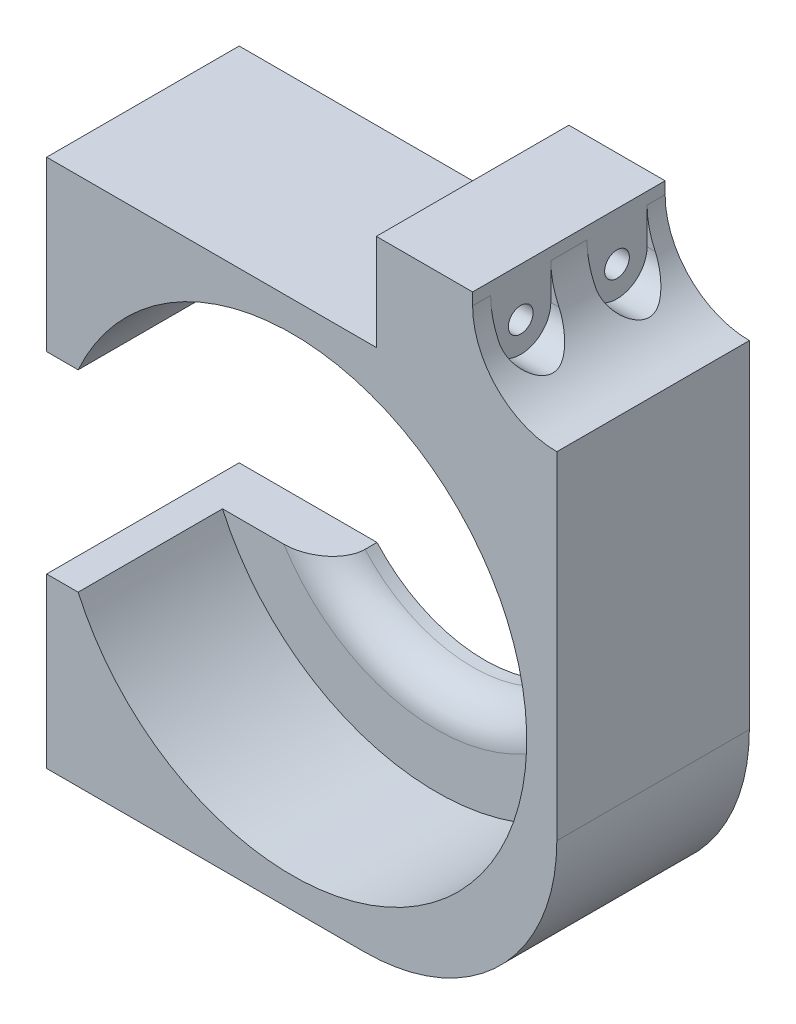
ISO-10303-21;
HEADER;
FILE_DESCRIPTION(('STEP AP214'),'2;1');
FILE_NAME('part.step','',(''),(''),'','','');
FILE_SCHEMA(('AUTOMOTIVE_DESIGN { 1 0 10303 214 1 1 1 1 }'));
ENDSEC;
DATA;
#1=APPLICATION_CONTEXT('core data for automotive mechanical design processes');
#2=APPLICATION_PROTOCOL_DEFINITION('international standard','automotive_design',2000,#1);
#3=PRODUCT_CONTEXT('',#1,'mechanical');
#4=PRODUCT('Part','Part','',(#3));
#5=PRODUCT_RELATED_PRODUCT_CATEGORY('part','',(#4));
#6=PRODUCT_DEFINITION_FORMATION('','',#4);
#7=PRODUCT_DEFINITION_CONTEXT('part definition',#1,'design');
#8=PRODUCT_DEFINITION('design','',#6,#7);
#9=PRODUCT_DEFINITION_SHAPE('','',#8);
#10=(LENGTH_UNIT() NAMED_UNIT(*) SI_UNIT(.MILLI.,.METRE.));
#11=(NAMED_UNIT(*) PLANE_ANGLE_UNIT() SI_UNIT($,.RADIAN.));
#12=(NAMED_UNIT(*) SI_UNIT($,.STERADIAN.) SOLID_ANGLE_UNIT());
#13=UNCERTAINTY_MEASURE_WITH_UNIT(LENGTH_MEASURE(1.E-05),#10,'distance_accuracy_value','');
#14=(GEOMETRIC_REPRESENTATION_CONTEXT(3) GLOBAL_UNCERTAINTY_ASSIGNED_CONTEXT((#13)) GLOBAL_UNIT_ASSIGNED_CONTEXT((#10,
#11,#12)) REPRESENTATION_CONTEXT('',''));
#15=CARTESIAN_POINT('',(0.,0.,0.));
#16=DIRECTION('',(0.,0.,1.));
#17=DIRECTION('',(1.,0.,0.));
#18=AXIS2_PLACEMENT_3D('',#15,#16,#17);
#19=CARTESIAN_POINT('',(5.08,-69.85,50.8));
#20=DIRECTION('',(1.,0.,0.));
#21=DIRECTION('',(0.,0.,-1.));
#22=AXIS2_PLACEMENT_3D('',#19,#20,#21);
#23=PLANE('',#22);
#24=DIRECTION('',(0.,-1.,0.));
#25=VECTOR('',#24,1.);
#26=CARTESIAN_POINT('',(5.08,-69.85,50.8));
#27=LINE('',#26,#25);
#28=CARTESIAN_POINT('',(5.08,-25.4,50.8));
#29=VERTEX_POINT('',#28);
#30=CARTESIAN_POINT('',(5.08,-69.85,50.8));
#31=VERTEX_POINT('',#30);
#32=EDGE_CURVE('E201',#29,#31,#27,.T.);
#33=ORIENTED_EDGE('',*,*,#32,.F.);
#34=DIRECTION('',(0.,0.,-1.));
#35=VECTOR('',#34,1.);
#36=CARTESIAN_POINT('',(5.08,-25.4,50.8));
#37=LINE('',#36,#35);
#38=CARTESIAN_POINT('',(5.08,-25.4,0.));
#39=VERTEX_POINT('',#38);
#40=EDGE_CURVE('E11',#29,#39,#37,.T.);
#41=ORIENTED_EDGE('',*,*,#40,.T.);
#42=DIRECTION('',(0.,-1.,0.));
#43=VECTOR('',#42,1.);
#44=CARTESIAN_POINT('',(5.08,-69.85,0.));
#45=LINE('',#44,#43);
#46=CARTESIAN_POINT('',(5.08,-69.85,0.));
#47=VERTEX_POINT('',#46);
#48=EDGE_CURVE('E202',#39,#47,#45,.T.);
#49=ORIENTED_EDGE('',*,*,#48,.T.);
#50=DIRECTION('',(0.,0.,-1.));
#51=VECTOR('',#50,1.);
#52=CARTESIAN_POINT('',(5.08,-69.85,50.8));
#53=LINE('',#52,#51);
#54=EDGE_CURVE('E209',#31,#47,#53,.T.);
#55=ORIENTED_EDGE('',*,*,#54,.F.);
#56=EDGE_LOOP('',(#33,#41,#49,#55));
#57=FACE_BOUND('',#56,.T.);
#58=ADVANCED_FACE('F33',(#57),#23,.F.);
#59=CARTESIAN_POINT('',(139.7,92.075,50.8));
#60=DIRECTION('',(0.,0.,-1.));
#61=DIRECTION('',(-1.,0.,0.));
#62=AXIS2_PLACEMENT_3D('',#59,#60,#61);
#63=CYLINDRICAL_SURFACE('',#62,22.225);
#64=CARTESIAN_POINT('',(139.7,92.075,4.7625));
#65=DIRECTION('',(0.,0.,1.));
#66=DIRECTION('',(1.,0.,0.));
#67=AXIS2_PLACEMENT_3D('',#64,#65,#66);
#68=CIRCLE('',#67,22.225);
#69=CARTESIAN_POINT('',(119.619536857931,82.5499999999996,4.7625));
#70=VERTEX_POINT('',#69);
#71=CARTESIAN_POINT('',(117.475,92.075,4.7625));
#72=VERTEX_POINT('',#71);
#73=EDGE_CURVE('E246',#70,#72,#68,.F.);
#74=ORIENTED_EDGE('',*,*,#73,.F.);
#75=CARTESIAN_POINT('',(125.951846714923,74.6124999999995,12.7));
#76=CARTESIAN_POINT('',(125.951850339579,74.612497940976,12.5272314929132));
#77=CARTESIAN_POINT('',(125.944655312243,74.618154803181,12.3544835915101));
#78=CARTESIAN_POINT('',(125.916216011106,74.640601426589,12.01080832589));
#79=CARTESIAN_POINT('',(125.894965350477,74.6573962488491,11.8398818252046));
#80=CARTESIAN_POINT('',(125.839285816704,74.7016733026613,11.5012996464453));
#81=CARTESIAN_POINT('',(125.804832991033,74.7291749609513,11.3336504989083));
#82=CARTESIAN_POINT('',(125.724097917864,74.7941589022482,11.0031653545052));
#83=CARTESIAN_POINT('',(125.677808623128,74.8316471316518,10.8403322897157));
#84=CARTESIAN_POINT('',(125.524955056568,74.9567102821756,10.3650398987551));
#85=CARTESIAN_POINT('',(125.403496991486,75.0575817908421,10.0607615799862));
#86=CARTESIAN_POINT('',(125.132289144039,75.2891689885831,9.47773154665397));
#87=CARTESIAN_POINT('',(124.982523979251,75.4199009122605,9.19899383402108));
#88=CARTESIAN_POINT('',(124.693414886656,75.680375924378,8.71592022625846));
#89=CARTESIAN_POINT('',(124.557232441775,75.8058658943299,8.5073367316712));
#90=CARTESIAN_POINT('',(124.276002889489,76.0722361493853,8.10647868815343));
#91=CARTESIAN_POINT('',(124.130951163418,76.2131244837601,7.91421276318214));
#92=CARTESIAN_POINT('',(123.834857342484,76.5092745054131,7.54543420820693));
#93=CARTESIAN_POINT('',(123.683806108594,76.6645586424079,7.36894705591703));
#94=CARTESIAN_POINT('',(123.378367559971,76.988433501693,7.03188769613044));
#95=CARTESIAN_POINT('',(123.223980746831,77.157022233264,6.87131311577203));
#96=CARTESIAN_POINT('',(122.908985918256,77.5123562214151,6.56132244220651));
#97=CARTESIAN_POINT('',(122.748334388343,77.6995045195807,6.41241266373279));
#98=CARTESIAN_POINT('',(122.427444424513,78.0866948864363,6.1318981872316));
#99=CARTESIAN_POINT('',(122.267206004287,78.2867373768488,6.00029405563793));
#100=CARTESIAN_POINT('',(121.948805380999,78.6991420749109,5.75504864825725));
#101=CARTESIAN_POINT('',(121.790643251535,78.911504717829,5.64140800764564));
#102=CARTESIAN_POINT('',(121.47794420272,79.347888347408,5.43303016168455));
#103=CARTESIAN_POINT('',(121.323407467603,79.5719099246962,5.33829391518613));
#104=CARTESIAN_POINT('',(121.003226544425,80.0552662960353,5.15987726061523));
#105=CARTESIAN_POINT('',(120.838153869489,80.315820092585,5.07845120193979));
#106=CARTESIAN_POINT('',(120.516180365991,80.8487537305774,4.9420804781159));
#107=CARTESIAN_POINT('',(120.359280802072,81.1211353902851,4.88713990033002));
#108=CARTESIAN_POINT('',(120.055791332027,81.6752255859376,4.80589118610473));
#109=CARTESIAN_POINT('',(119.909185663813,81.9569188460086,4.77953834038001));
#110=CARTESIAN_POINT('',(119.627809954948,82.5272889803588,4.75740946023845));
#111=CARTESIAN_POINT('',(119.493034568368,82.8159626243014,4.76161954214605));
#112=CARTESIAN_POINT('',(119.273220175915,83.314345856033,4.79663509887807));
#113=CARTESIAN_POINT('',(119.184924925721,83.5232029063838,4.81954959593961));
#114=CARTESIAN_POINT('',(119.015614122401,83.9412669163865,4.88252355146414));
#115=CARTESIAN_POINT('',(118.934597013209,84.1504737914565,4.92257933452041));
#116=CARTESIAN_POINT('',(118.78021131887,84.5675044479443,5.02019392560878));
#117=CARTESIAN_POINT('',(118.706838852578,84.7753288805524,5.07774379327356));
#118=CARTESIAN_POINT('',(118.567883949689,85.1879336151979,5.21052887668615));
#119=CARTESIAN_POINT('',(118.502301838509,85.3927137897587,5.28576483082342));
#120=CARTESIAN_POINT('',(118.378784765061,85.7979457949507,5.45410245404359));
#121=CARTESIAN_POINT('',(118.320872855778,85.9983831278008,5.54725600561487));
#122=CARTESIAN_POINT('',(118.212787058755,86.3923912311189,5.75096275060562));
#123=CARTESIAN_POINT('',(118.16261318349,86.5859619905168,5.86151597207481));
#124=CARTESIAN_POINT('',(118.06969555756,86.9643714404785,6.09945542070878));
#125=CARTESIAN_POINT('',(118.026952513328,87.1492092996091,6.22684324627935));
#126=CARTESIAN_POINT('',(117.948448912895,87.5083337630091,6.49762932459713));
#127=CARTESIAN_POINT('',(117.912688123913,87.6826207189,6.64102704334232));
#128=CARTESIAN_POINT('',(117.849205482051,88.0105333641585,6.9352324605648));
#129=CARTESIAN_POINT('',(117.821170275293,88.1647569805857,7.08530721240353));
#130=CARTESIAN_POINT('',(117.770306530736,88.4608961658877,7.39796504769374));
#131=CARTESIAN_POINT('',(117.747478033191,88.6028116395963,7.56054822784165));
#132=CARTESIAN_POINT('',(117.706419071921,88.8731685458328,7.897080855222));
#133=CARTESIAN_POINT('',(117.688188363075,89.0016106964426,8.07102969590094));
#134=CARTESIAN_POINT('',(117.655700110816,89.2440233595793,8.42908658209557));
#135=CARTESIAN_POINT('',(117.641442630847,89.3579936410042,8.6131947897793));
#136=CARTESIAN_POINT('',(117.616234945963,89.5710992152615,8.99117715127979));
#137=CARTESIAN_POINT('',(117.605300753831,89.6701615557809,9.18509349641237));
#138=CARTESIAN_POINT('',(117.586255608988,89.85209480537,9.58059067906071));
#139=CARTESIAN_POINT('',(117.578145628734,89.9349601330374,9.7821741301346));
#140=CARTESIAN_POINT('',(117.564247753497,90.0838467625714,10.1915171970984));
#141=CARTESIAN_POINT('',(117.558459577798,90.1498701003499,10.3992760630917));
#142=CARTESIAN_POINT('',(117.548782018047,90.2646174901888,10.8195644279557));
#143=CARTESIAN_POINT('',(117.544892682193,90.3133411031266,11.0320940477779));
#144=CARTESIAN_POINT('',(117.53864149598,90.3937883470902,11.4639177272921));
#145=CARTESIAN_POINT('',(117.536305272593,90.4252253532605,11.6832656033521));
#146=CARTESIAN_POINT('',(117.533042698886,90.4696570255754,12.1238390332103));
#147=CARTESIAN_POINT('',(117.532116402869,90.4826509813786,12.3450646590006));
#148=CARTESIAN_POINT('',(117.53158249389,90.4901010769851,12.7877891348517));
#149=CARTESIAN_POINT('',(117.531974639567,90.4845606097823,13.0092879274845));
#150=CARTESIAN_POINT('',(117.534116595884,90.454982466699,13.4511365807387));
#151=CARTESIAN_POINT('',(117.535866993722,90.4309367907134,13.6714859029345));
#152=CARTESIAN_POINT('',(117.540907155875,90.3643426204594,14.1104944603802));
#153=CARTESIAN_POINT('',(117.54420465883,90.3217011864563,14.3291395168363));
#154=CARTESIAN_POINT('',(117.552636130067,90.2182317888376,14.7619436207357));
#155=CARTESIAN_POINT('',(117.557769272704,90.1574120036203,14.9761046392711));
#156=CARTESIAN_POINT('',(117.570285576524,90.0179971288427,15.3985978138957));
#157=CARTESIAN_POINT('',(117.577669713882,89.9393943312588,15.6069273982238));
#158=CARTESIAN_POINT('',(117.595194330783,89.7650522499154,16.0160754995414));
#159=CARTESIAN_POINT('',(117.605333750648,89.6693195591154,16.2168968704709));
#160=CARTESIAN_POINT('',(117.628922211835,89.4617608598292,16.6090312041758));
#161=CARTESIAN_POINT('',(117.64236074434,89.3499864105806,16.800372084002));
#162=CARTESIAN_POINT('',(117.673201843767,89.1109997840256,17.1728229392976));
#163=CARTESIAN_POINT('',(117.690604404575,88.9837876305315,17.3539329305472));
#164=CARTESIAN_POINT('',(117.730035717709,88.7149795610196,17.7045705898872));
#165=CARTESIAN_POINT('',(117.752063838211,88.5733856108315,17.8740998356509));
#166=CARTESIAN_POINT('',(117.801407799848,88.2769944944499,18.2003646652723));
#167=CARTESIAN_POINT('',(117.828723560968,88.1221975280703,18.3571004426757));
#168=CARTESIAN_POINT('',(117.888810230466,87.8031655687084,18.6544089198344));
#169=CARTESIAN_POINT('',(117.921493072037,87.6391071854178,18.7951889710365));
#170=CARTESIAN_POINT('',(117.993119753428,87.300919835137,19.0623185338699));
#171=CARTESIAN_POINT('',(118.032063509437,87.1267910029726,19.1886682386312));
#172=CARTESIAN_POINT('',(118.11663658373,86.7700360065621,19.4261514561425));
#173=CARTESIAN_POINT('',(118.162264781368,86.5874112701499,19.5372875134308));
#174=CARTESIAN_POINT('',(118.260523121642,86.2152656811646,19.7437928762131));
#175=CARTESIAN_POINT('',(118.313153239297,86.0257448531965,19.8391622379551));
#176=CARTESIAN_POINT('',(118.425026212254,85.6434069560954,20.0128920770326));
#177=CARTESIAN_POINT('',(118.48419749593,85.4506419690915,20.0914134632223));
#178=CARTESIAN_POINT('',(118.609604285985,85.061612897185,20.2324976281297));
#179=CARTESIAN_POINT('',(118.675839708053,84.8653488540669,20.2950605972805));
#180=CARTESIAN_POINT('',(118.815276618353,84.4708748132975,20.4042869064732));
#181=CARTESIAN_POINT('',(118.888478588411,84.2726646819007,20.4509491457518));
#182=CARTESIAN_POINT('',(119.041622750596,83.8757727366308,20.5286097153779));
#183=CARTESIAN_POINT('',(119.121565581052,83.6770908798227,20.5596065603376));
#184=CARTESIAN_POINT('',(119.291514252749,83.2718927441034,20.6073513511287));
#185=CARTESIAN_POINT('',(119.381808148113,83.0654165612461,20.6234120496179));
#186=CARTESIAN_POINT('',(119.568890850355,82.6548100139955,20.6394673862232));
#187=CARTESIAN_POINT('',(119.665679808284,82.4506797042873,20.6394616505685));
#188=CARTESIAN_POINT('',(119.865211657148,82.0459062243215,20.6240662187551));
#189=CARTESIAN_POINT('',(119.967955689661,81.8452637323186,20.6086735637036));
#190=CARTESIAN_POINT('',(120.17877400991,81.4484837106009,20.5632342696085));
#191=CARTESIAN_POINT('',(120.286848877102,81.2523466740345,20.5331860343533));
#192=CARTESIAN_POINT('',(120.521326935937,80.8414895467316,20.4546039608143));
#193=CARTESIAN_POINT('',(120.648344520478,80.6274687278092,20.4042444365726));
#194=CARTESIAN_POINT('',(120.907327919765,80.2070992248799,20.2869855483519));
#195=CARTESIAN_POINT('',(121.039294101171,80.0007511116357,20.2200849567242));
#196=CARTESIAN_POINT('',(121.307283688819,79.5963182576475,20.0706295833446));
#197=CARTESIAN_POINT('',(121.443309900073,79.3982394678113,19.9880637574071));
#198=CARTESIAN_POINT('',(121.718324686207,79.0110656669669,19.8081241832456));
#199=CARTESIAN_POINT('',(121.85731351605,78.8219714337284,19.7107491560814));
#200=CARTESIAN_POINT('',(122.160748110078,78.4222216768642,19.4842932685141));
#201=CARTESIAN_POINT('',(122.325544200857,78.2132879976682,19.3526343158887));
#202=CARTESIAN_POINT('',(122.655978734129,77.8089510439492,19.0708015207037));
#203=CARTESIAN_POINT('',(122.821617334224,77.6135504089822,18.9206240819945));
#204=CARTESIAN_POINT('',(123.151767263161,77.2368952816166,18.6021751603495));
#205=CARTESIAN_POINT('',(123.31627819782,77.0556455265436,18.4338976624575));
#206=CARTESIAN_POINT('',(123.641754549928,76.7081526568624,18.0794345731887));
#207=CARTESIAN_POINT('',(123.802720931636,76.5419054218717,17.8932539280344));
#208=CARTESIAN_POINT('',(124.081132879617,76.2626360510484,17.5486995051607));
#209=CARTESIAN_POINT('',(124.199910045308,76.1462920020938,17.3940848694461));
#210=CARTESIAN_POINT('',(124.432152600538,75.923550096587,17.0740246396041));
#211=CARTESIAN_POINT('',(124.545617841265,75.8171525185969,16.9085787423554));
#212=CARTESIAN_POINT('',(124.765143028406,75.6152652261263,16.5668667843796));
#213=CARTESIAN_POINT('',(124.871213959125,75.5197591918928,16.3906175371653));
#214=CARTESIAN_POINT('',(125.073720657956,75.3405783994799,16.0270487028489));
#215=CARTESIAN_POINT('',(125.170160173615,75.256899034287,15.8397334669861));
#216=CARTESIAN_POINT('',(125.387306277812,75.0713173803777,15.3755067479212));
#217=CARTESIAN_POINT('',(125.502012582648,74.9757694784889,15.0930446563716));
#218=CARTESIAN_POINT('',(125.648516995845,74.8555205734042,14.6549491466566));
#219=CARTESIAN_POINT('',(125.693072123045,74.8192990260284,14.5066171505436));
#220=CARTESIAN_POINT('',(125.772540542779,74.7550953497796,14.2056622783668));
#221=CARTESIAN_POINT('',(125.807457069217,74.7271104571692,14.0530408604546));
#222=CARTESIAN_POINT('',(125.874503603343,74.6736029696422,13.7027556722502));
#223=CARTESIAN_POINT('',(125.903351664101,74.6507724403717,13.5040292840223));
#224=CARTESIAN_POINT('',(125.942022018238,74.620221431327,13.1035260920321));
#225=CARTESIAN_POINT('',(125.95184248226,74.6125024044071,12.9017489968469));
#226=CARTESIAN_POINT('',(125.951846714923,74.6124999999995,12.7));
#227=B_SPLINE_CURVE_WITH_KNOTS('',3,(#75,#76,#77,#78,#79,#80,#81,#82,#83,#84,#85,#86,#87,#88,
#89,#90,#91,#92,#93,#94,#95,#96,#97,#98,#99,#100,#101,#102,#103,#104,#105,#106,#107,#108,#109,
#110,#111,#112,#113,#114,#115,#116,#117,#118,#119,#120,#121,#122,#123,#124,#125,#126,#127,#128,
#129,#130,#131,#132,#133,#134,#135,#136,#137,#138,#139,#140,#141,#142,#143,#144,#145,#146,#147,
#148,#149,#150,#151,#152,#153,#154,#155,#156,#157,#158,#159,#160,#161,#162,#163,#164,#165,#166,
#167,#168,#169,#170,#171,#172,#173,#174,#175,#176,#177,#178,#179,#180,#181,#182,#183,#184,#185,
#186,#187,#188,#189,#190,#191,#192,#193,#194,#195,#196,#197,#198,#199,#200,#201,#202,#203,#204,
#205,#206,#207,#208,#209,#210,#211,#212,#213,#214,#215,#216,#217,#218,#219,#220,#221,#222,#223,
#224,#225,#226),.UNSPECIFIED.,.T.,.F.,(4,2,2,2,2,2,2,2,2,2,2,2,2,2,2,2,2,2,2,2,2,2,2,2,2,2,2,2,
2,2,2,2,2,2,2,2,2,2,2,2,2,2,2,2,2,2,2,2,2,2,2,2,2,2,2,2,2,2,2,2,2,2,2,2,2,2,2,2,2,2,2,2,2,2,2,
4),(0.,0.518032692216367,1.03630093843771,1.55551395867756,2.0750368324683,3.09883678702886,
4.12319469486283,4.95887510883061,5.79499447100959,6.63244039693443,7.4697612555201,
8.3332800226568,9.19682704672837,10.0604045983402,10.9240259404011,11.8796887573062,
12.8354990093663,13.7898122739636,14.7436920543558,15.426725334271,16.1096122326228,
16.7921507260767,17.4747177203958,18.1592917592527,18.8438669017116,19.5285070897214,
20.2131244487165,20.863386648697,21.5136538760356,22.1638864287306,22.8141293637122,
23.467457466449,24.1210103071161,24.7744841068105,25.4279744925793,26.0919964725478,
26.7560440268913,27.4199700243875,28.084183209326,28.7517548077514,29.4190265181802,
30.0865880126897,30.7538931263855,31.4190996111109,32.0843050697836,32.7494197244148,
33.414524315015,34.0696424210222,34.7247517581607,35.3797513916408,36.034748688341,
36.6831805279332,37.3316046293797,37.9800736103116,38.6286040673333,39.3056807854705,
39.9827732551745,40.6599959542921,41.3372924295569,42.098297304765,42.8593586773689,
43.6209586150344,44.3826243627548,45.2723795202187,46.1623077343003,47.0525326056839,
47.9425122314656,48.6231689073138,49.3038446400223,49.9834866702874,50.6628632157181,
51.6175128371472,52.0942235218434,52.5707740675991,53.1756443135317,53.7805727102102),.UNSPECIFIED.);
#228=CARTESIAN_POINT('',(119.619536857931,82.5499999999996,20.6375));
#229=VERTEX_POINT('',#228);
#230=EDGE_CURVE('E330',#229,#70,#227,.T.);
#231=ORIENTED_EDGE('',*,*,#230,.F.);
#232=CARTESIAN_POINT('',(139.7,92.075,20.6375));
#233=DIRECTION('',(0.,0.,-1.));
#234=DIRECTION('',(-1.,0.,0.));
#235=AXIS2_PLACEMENT_3D('',#232,#233,#234);
#236=CIRCLE('',#235,22.225);
#237=CARTESIAN_POINT('',(117.475000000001,92.075,20.6375));
#238=VERTEX_POINT('',#237);
#239=EDGE_CURVE('E244',#238,#229,#236,.F.);
#240=ORIENTED_EDGE('',*,*,#239,.F.);
#241=DIRECTION('',(0.,0.,-1.));
#242=VECTOR('',#241,1.);
#243=CARTESIAN_POINT('',(117.475,92.075,50.8));
#244=LINE('',#243,#242);
#245=CARTESIAN_POINT('',(117.475,92.075,30.1625));
#246=VERTEX_POINT('',#245);
#247=EDGE_CURVE('E320',#246,#238,#244,.T.);
#248=ORIENTED_EDGE('',*,*,#247,.F.);
#249=CARTESIAN_POINT('',(139.7,92.075,30.1625));
#250=DIRECTION('',(0.,0.,1.));
#251=DIRECTION('',(1.,0.,0.));
#252=AXIS2_PLACEMENT_3D('',#249,#250,#251);
#253=CIRCLE('',#252,22.225);
#254=CARTESIAN_POINT('',(119.619536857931,82.5499999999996,30.1625));
#255=VERTEX_POINT('',#254);
#256=EDGE_CURVE('E240',#255,#246,#253,.F.);
#257=ORIENTED_EDGE('',*,*,#256,.F.);
#258=CARTESIAN_POINT('',(125.951846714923,74.6124999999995,38.1));
#259=CARTESIAN_POINT('',(125.951850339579,74.612497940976,37.9272314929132));
#260=CARTESIAN_POINT('',(125.944655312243,74.618154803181,37.7544835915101));
#261=CARTESIAN_POINT('',(125.916216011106,74.640601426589,37.41080832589));
#262=CARTESIAN_POINT('',(125.894965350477,74.6573962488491,37.2398818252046));
#263=CARTESIAN_POINT('',(125.839285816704,74.7016733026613,36.9012996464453));
#264=CARTESIAN_POINT('',(125.804832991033,74.7291749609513,36.7336504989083));
#265=CARTESIAN_POINT('',(125.724097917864,74.7941589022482,36.4031653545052));
#266=CARTESIAN_POINT('',(125.677808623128,74.8316471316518,36.2403322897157));
#267=CARTESIAN_POINT('',(125.524955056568,74.9567102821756,35.7650398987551));
#268=CARTESIAN_POINT('',(125.403496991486,75.0575817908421,35.4607615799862));
#269=CARTESIAN_POINT('',(125.132289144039,75.2891689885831,34.877731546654));
#270=CARTESIAN_POINT('',(124.982523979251,75.4199009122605,34.5989938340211));
#271=CARTESIAN_POINT('',(124.693414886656,75.680375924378,34.1159202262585));
#272=CARTESIAN_POINT('',(124.557232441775,75.8058658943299,33.9073367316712));
#273=CARTESIAN_POINT('',(124.276002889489,76.0722361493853,33.5064786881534));
#274=CARTESIAN_POINT('',(124.130951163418,76.2131244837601,33.3142127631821));
#275=CARTESIAN_POINT('',(123.834857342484,76.5092745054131,32.9454342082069));
#276=CARTESIAN_POINT('',(123.683806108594,76.6645586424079,32.768947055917));
#277=CARTESIAN_POINT('',(123.378367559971,76.988433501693,32.4318876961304));
#278=CARTESIAN_POINT('',(123.223980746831,77.157022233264,32.271313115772));
#279=CARTESIAN_POINT('',(122.908985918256,77.5123562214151,31.9613224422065));
#280=CARTESIAN_POINT('',(122.748334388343,77.6995045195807,31.8124126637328));
#281=CARTESIAN_POINT('',(122.427444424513,78.0866948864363,31.5318981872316));
#282=CARTESIAN_POINT('',(122.267206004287,78.2867373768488,31.4002940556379));
#283=CARTESIAN_POINT('',(121.948805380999,78.6991420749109,31.1550486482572));
#284=CARTESIAN_POINT('',(121.790643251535,78.911504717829,31.0414080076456));
#285=CARTESIAN_POINT('',(121.47794420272,79.347888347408,30.8330301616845));
#286=CARTESIAN_POINT('',(121.323407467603,79.5719099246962,30.7382939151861));
#287=CARTESIAN_POINT('',(121.003226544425,80.0552662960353,30.5598772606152));
#288=CARTESIAN_POINT('',(120.838153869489,80.315820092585,30.4784512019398));
#289=CARTESIAN_POINT('',(120.516180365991,80.8487537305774,30.3420804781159));
#290=CARTESIAN_POINT('',(120.359280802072,81.1211353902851,30.28713990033));
#291=CARTESIAN_POINT('',(120.055791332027,81.6752255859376,30.2058911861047));
#292=CARTESIAN_POINT('',(119.909185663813,81.9569188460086,30.17953834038));
#293=CARTESIAN_POINT('',(119.627809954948,82.5272889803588,30.1574094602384));
#294=CARTESIAN_POINT('',(119.493034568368,82.8159626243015,30.161619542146));
#295=CARTESIAN_POINT('',(119.273220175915,83.314345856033,30.1966350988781));
#296=CARTESIAN_POINT('',(119.184924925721,83.5232029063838,30.2195495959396));
#297=CARTESIAN_POINT('',(119.015614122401,83.9412669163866,30.2825235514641));
#298=CARTESIAN_POINT('',(118.934597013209,84.1504737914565,30.3225793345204));
#299=CARTESIAN_POINT('',(118.78021131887,84.5675044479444,30.4201939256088));
#300=CARTESIAN_POINT('',(118.706838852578,84.7753288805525,30.4777437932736));
#301=CARTESIAN_POINT('',(118.567883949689,85.1879336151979,30.6105288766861));
#302=CARTESIAN_POINT('',(118.502301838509,85.3927137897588,30.6857648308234));
#303=CARTESIAN_POINT('',(118.378784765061,85.7979457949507,30.8541024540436));
#304=CARTESIAN_POINT('',(118.320872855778,85.9983831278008,30.9472560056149));
#305=CARTESIAN_POINT('',(118.212787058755,86.3923912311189,31.1509627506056));
#306=CARTESIAN_POINT('',(118.16261318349,86.5859619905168,31.2615159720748));
#307=CARTESIAN_POINT('',(118.06969555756,86.9643714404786,31.4994554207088));
#308=CARTESIAN_POINT('',(118.026952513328,87.1492092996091,31.6268432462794));
#309=CARTESIAN_POINT('',(117.948448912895,87.5083337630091,31.8976293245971));
#310=CARTESIAN_POINT('',(117.912688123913,87.6826207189,32.0410270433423));
#311=CARTESIAN_POINT('',(117.849205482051,88.0105333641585,32.3352324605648));
#312=CARTESIAN_POINT('',(117.821170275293,88.1647569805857,32.4853072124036));
#313=CARTESIAN_POINT('',(117.770306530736,88.4608961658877,32.7979650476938));
#314=CARTESIAN_POINT('',(117.747478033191,88.6028116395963,32.9605482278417));
#315=CARTESIAN_POINT('',(117.706419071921,88.8731685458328,33.297080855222));
#316=CARTESIAN_POINT('',(117.688188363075,89.0016106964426,33.471029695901));
#317=CARTESIAN_POINT('',(117.655700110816,89.2440233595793,33.8290865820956));
#318=CARTESIAN_POINT('',(117.641442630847,89.3579936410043,34.0131947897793));
#319=CARTESIAN_POINT('',(117.616234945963,89.5710992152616,34.3911771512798));
#320=CARTESIAN_POINT('',(117.605300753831,89.6701615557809,34.5850934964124));
#321=CARTESIAN_POINT('',(117.586255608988,89.8520948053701,34.9805906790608));
#322=CARTESIAN_POINT('',(117.578145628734,89.9349601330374,35.1821741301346));
#323=CARTESIAN_POINT('',(117.564247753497,90.0838467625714,35.5915171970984));
#324=CARTESIAN_POINT('',(117.558459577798,90.1498701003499,35.7992760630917));
#325=CARTESIAN_POINT('',(117.548782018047,90.2646174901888,36.2195644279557));
#326=CARTESIAN_POINT('',(117.544892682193,90.3133411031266,36.4320940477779));
#327=CARTESIAN_POINT('',(117.53864149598,90.3937883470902,36.8639177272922));
#328=CARTESIAN_POINT('',(117.536305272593,90.4252253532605,37.0832656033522));
#329=CARTESIAN_POINT('',(117.533042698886,90.4696570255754,37.5238390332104));
#330=CARTESIAN_POINT('',(117.532116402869,90.4826509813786,37.7450646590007));
#331=CARTESIAN_POINT('',(117.53158249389,90.4901010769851,38.1877891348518));
#332=CARTESIAN_POINT('',(117.531974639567,90.4845606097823,38.4092879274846));
#333=CARTESIAN_POINT('',(117.534116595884,90.454982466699,38.8511365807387));
#334=CARTESIAN_POINT('',(117.535866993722,90.4309367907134,39.0714859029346));
#335=CARTESIAN_POINT('',(117.540907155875,90.3643426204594,39.5104944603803));
#336=CARTESIAN_POINT('',(117.54420465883,90.3217011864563,39.7291395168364));
#337=CARTESIAN_POINT('',(117.552636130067,90.2182317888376,40.1619436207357));
#338=CARTESIAN_POINT('',(117.557769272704,90.1574120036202,40.3761046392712));
#339=CARTESIAN_POINT('',(117.570285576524,90.0179971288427,40.7985978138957));
#340=CARTESIAN_POINT('',(117.577669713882,89.9393943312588,41.0069273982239));
#341=CARTESIAN_POINT('',(117.595194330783,89.7650522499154,41.4160754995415));
#342=CARTESIAN_POINT('',(117.605333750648,89.6693195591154,41.6168968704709));
#343=CARTESIAN_POINT('',(117.628922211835,89.4617608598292,42.0090312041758));
#344=CARTESIAN_POINT('',(117.64236074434,89.3499864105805,42.2003720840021));
#345=CARTESIAN_POINT('',(117.673201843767,89.1109997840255,42.5728229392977));
#346=CARTESIAN_POINT('',(117.690604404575,88.9837876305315,42.7539329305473));
#347=CARTESIAN_POINT('',(117.730035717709,88.7149795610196,43.1045705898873));
#348=CARTESIAN_POINT('',(117.752063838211,88.5733856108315,43.2740998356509));
#349=CARTESIAN_POINT('',(117.801407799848,88.2769944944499,43.6003646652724));
#350=CARTESIAN_POINT('',(117.828723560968,88.1221975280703,43.7571004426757));
#351=CARTESIAN_POINT('',(117.888810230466,87.8031655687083,44.0544089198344));
#352=CARTESIAN_POINT('',(117.921493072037,87.6391071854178,44.1951889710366));
#353=CARTESIAN_POINT('',(117.993119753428,87.3009198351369,44.4623185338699));
#354=CARTESIAN_POINT('',(118.032063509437,87.1267910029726,44.5886682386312));
#355=CARTESIAN_POINT('',(118.11663658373,86.7700360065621,44.8261514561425));
#356=CARTESIAN_POINT('',(118.162264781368,86.5874112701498,44.9372875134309));
#357=CARTESIAN_POINT('',(118.260523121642,86.2152656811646,45.1437928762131));
#358=CARTESIAN_POINT('',(118.313153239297,86.0257448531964,45.2391622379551));
#359=CARTESIAN_POINT('',(118.425026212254,85.6434069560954,45.4128920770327));
#360=CARTESIAN_POINT('',(118.48419749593,85.4506419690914,45.4914134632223));
#361=CARTESIAN_POINT('',(118.609604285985,85.061612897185,45.6324976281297));
#362=CARTESIAN_POINT('',(118.675839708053,84.8653488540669,45.6950605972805));
#363=CARTESIAN_POINT('',(118.815276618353,84.4708748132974,45.8042869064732));
#364=CARTESIAN_POINT('',(118.888478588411,84.2726646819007,45.8509491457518));
#365=CARTESIAN_POINT('',(119.041622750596,83.8757727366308,45.9286097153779));
#366=CARTESIAN_POINT('',(119.121565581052,83.6770908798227,45.9596065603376));
#367=CARTESIAN_POINT('',(119.291514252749,83.2718927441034,46.0073513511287));
#368=CARTESIAN_POINT('',(119.381808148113,83.065416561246,46.0234120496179));
#369=CARTESIAN_POINT('',(119.568890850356,82.6548100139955,46.0394673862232));
#370=CARTESIAN_POINT('',(119.665679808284,82.4506797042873,46.0394616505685));
#371=CARTESIAN_POINT('',(119.865211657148,82.0459062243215,46.0240662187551));
#372=CARTESIAN_POINT('',(119.967955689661,81.8452637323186,46.0086735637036));
#373=CARTESIAN_POINT('',(120.17877400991,81.4484837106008,45.9632342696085));
#374=CARTESIAN_POINT('',(120.286848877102,81.2523466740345,45.9331860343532));
#375=CARTESIAN_POINT('',(120.521326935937,80.8414895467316,45.8546039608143));
#376=CARTESIAN_POINT('',(120.648344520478,80.6274687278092,45.8042444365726));
#377=CARTESIAN_POINT('',(120.907327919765,80.2070992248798,45.6869855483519));
#378=CARTESIAN_POINT('',(121.039294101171,80.0007511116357,45.6200849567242));
#379=CARTESIAN_POINT('',(121.307283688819,79.5963182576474,45.4706295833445));
#380=CARTESIAN_POINT('',(121.443309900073,79.3982394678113,45.3880637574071));
#381=CARTESIAN_POINT('',(121.718324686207,79.0110656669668,45.2081241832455));
#382=CARTESIAN_POINT('',(121.85731351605,78.8219714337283,45.1107491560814));
#383=CARTESIAN_POINT('',(122.160748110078,78.4222216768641,44.8842932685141));
#384=CARTESIAN_POINT('',(122.325544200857,78.2132879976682,44.7526343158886));
#385=CARTESIAN_POINT('',(122.655978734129,77.8089510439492,44.4708015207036));
#386=CARTESIAN_POINT('',(122.821617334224,77.6135504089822,44.3206240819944));
#387=CARTESIAN_POINT('',(123.151767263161,77.2368952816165,44.0021751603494));
#388=CARTESIAN_POINT('',(123.31627819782,77.0556455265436,43.8338976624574));
#389=CARTESIAN_POINT('',(123.641754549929,76.7081526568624,43.4794345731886));
#390=CARTESIAN_POINT('',(123.802720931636,76.5419054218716,43.2932539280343));
#391=CARTESIAN_POINT('',(124.081132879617,76.2626360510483,42.9486995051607));
#392=CARTESIAN_POINT('',(124.199910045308,76.1462920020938,42.794084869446));
#393=CARTESIAN_POINT('',(124.432152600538,75.9235500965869,42.4740246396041));
#394=CARTESIAN_POINT('',(124.545617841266,75.8171525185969,42.3085787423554));
#395=CARTESIAN_POINT('',(124.765143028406,75.6152652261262,41.9668667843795));
#396=CARTESIAN_POINT('',(124.871213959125,75.5197591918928,41.7906175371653));
#397=CARTESIAN_POINT('',(125.073720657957,75.3405783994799,41.4270487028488));
#398=CARTESIAN_POINT('',(125.170160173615,75.256899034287,41.2397334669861));
#399=CARTESIAN_POINT('',(125.387306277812,75.0713173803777,40.7755067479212));
#400=CARTESIAN_POINT('',(125.502012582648,74.9757694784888,40.4930446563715));
#401=CARTESIAN_POINT('',(125.648516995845,74.8555205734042,40.0549491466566));
#402=CARTESIAN_POINT('',(125.693072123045,74.8192990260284,39.9066171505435));
#403=CARTESIAN_POINT('',(125.772540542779,74.7550953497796,39.6056622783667));
#404=CARTESIAN_POINT('',(125.807457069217,74.7271104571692,39.4530408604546));
#405=CARTESIAN_POINT('',(125.874503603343,74.6736029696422,39.1027556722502));
#406=CARTESIAN_POINT('',(125.903351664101,74.6507724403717,38.9040292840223));
#407=CARTESIAN_POINT('',(125.942022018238,74.620221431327,38.5035260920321));
#408=CARTESIAN_POINT('',(125.95184248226,74.6125024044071,38.3017489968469));
#409=CARTESIAN_POINT('',(125.951846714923,74.6124999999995,38.1));
#410=B_SPLINE_CURVE_WITH_KNOTS('',3,(#258,#259,#260,#261,#262,#263,#264,#265,#266,#267,#268,
#269,#270,#271,#272,#273,#274,#275,#276,#277,#278,#279,#280,#281,#282,#283,#284,#285,#286,#287,
#288,#289,#290,#291,#292,#293,#294,#295,#296,#297,#298,#299,#300,#301,#302,#303,#304,#305,#306,
#307,#308,#309,#310,#311,#312,#313,#314,#315,#316,#317,#318,#319,#320,#321,#322,#323,#324,#325,
#326,#327,#328,#329,#330,#331,#332,#333,#334,#335,#336,#337,#338,#339,#340,#341,#342,#343,#344,
#345,#346,#347,#348,#349,#350,#351,#352,#353,#354,#355,#356,#357,#358,#359,#360,#361,#362,#363,
#364,#365,#366,#367,#368,#369,#370,#371,#372,#373,#374,#375,#376,#377,#378,#379,#380,#381,#382,
#383,#384,#385,#386,#387,#388,#389,#390,#391,#392,#393,#394,#395,#396,#397,#398,#399,#400,#401,
#402,#403,#404,#405,#406,#407,#408,#409),.UNSPECIFIED.,.T.,.F.,(4,2,2,2,2,2,2,2,2,2,2,2,2,2,2,2,
2,2,2,2,2,2,2,2,2,2,2,2,2,2,2,2,2,2,2,2,2,2,2,2,2,2,2,2,2,2,2,2,2,2,2,2,2,2,2,2,2,2,2,2,2,2,2,2,
2,2,2,2,2,2,2,2,2,2,2,4),(0.,0.518032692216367,1.03630093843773,1.55551395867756,
2.0750368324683,3.09883678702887,4.12319469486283,4.95887510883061,5.7949944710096,
6.63244039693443,7.4697612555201,8.33328002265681,9.19682704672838,10.0604045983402,
10.924025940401,11.8796887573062,12.8354990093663,13.7898122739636,14.7436920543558,
15.426725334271,16.1096122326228,16.7921507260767,17.4747177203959,18.1592917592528,
18.8438669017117,19.5285070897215,20.2131244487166,20.8633866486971,21.5136538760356,
22.1638864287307,22.8141293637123,23.4674574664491,24.1210103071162,24.7744841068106,
25.4279744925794,26.0919964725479,26.7560440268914,27.4199700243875,28.084183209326,
28.7517548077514,29.4190265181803,30.0865880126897,30.7538931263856,31.419099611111,
32.0843050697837,32.7494197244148,33.4145243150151,34.0696424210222,34.7247517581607,
35.3797513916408,36.0347486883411,36.6831805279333,37.3316046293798,37.9800736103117,
38.6286040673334,39.3056807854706,39.9827732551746,40.6599959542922,41.337292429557,
42.0982973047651,42.859358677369,43.6209586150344,44.3826243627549,45.2723795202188,
46.1623077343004,47.052532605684,47.9425122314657,48.6231689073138,49.3038446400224,
49.9834866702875,50.6628632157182,51.6175128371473,52.0942235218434,52.5707740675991,
53.1756443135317,53.7805727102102),.UNSPECIFIED.);
#411=CARTESIAN_POINT('',(119.619536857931,82.5499999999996,46.0375));
#412=VERTEX_POINT('',#411);
#413=EDGE_CURVE('E319',#412,#255,#410,.T.);
#414=ORIENTED_EDGE('',*,*,#413,.F.);
#415=CARTESIAN_POINT('',(139.7,92.075,46.0375));
#416=DIRECTION('',(0.,0.,-1.));
#417=DIRECTION('',(-1.,0.,0.));
#418=AXIS2_PLACEMENT_3D('',#415,#416,#417);
#419=CIRCLE('',#418,22.225);
#420=CARTESIAN_POINT('',(117.475000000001,92.075,46.0375));
#421=VERTEX_POINT('',#420);
#422=EDGE_CURVE('E238',#421,#412,#419,.F.);
#423=ORIENTED_EDGE('',*,*,#422,.F.);
#424=CARTESIAN_POINT('',(117.475,92.075,50.8));
#425=VERTEX_POINT('',#424);
#426=EDGE_CURVE('E316',#425,#421,#244,.T.);
#427=ORIENTED_EDGE('',*,*,#426,.F.);
#428=CARTESIAN_POINT('',(139.7,92.075,50.8));
#429=DIRECTION('',(0.,0.,-1.));
#430=DIRECTION('',(1.,0.,0.));
#431=AXIS2_PLACEMENT_3D('',#428,#429,#430);
#432=CIRCLE('',#431,22.225);
#433=CARTESIAN_POINT('',(139.7,69.85,50.8));
#434=VERTEX_POINT('',#433);
#435=EDGE_CURVE('E263',#434,#425,#432,.T.);
#436=ORIENTED_EDGE('',*,*,#435,.F.);
#437=DIRECTION('',(0.,0.,-1.));
#438=VECTOR('',#437,1.);
#439=CARTESIAN_POINT('',(139.7,69.85,50.8));
#440=LINE('',#439,#438);
#441=CARTESIAN_POINT('',(139.7,69.85,0.));
#442=VERTEX_POINT('',#441);
#443=EDGE_CURVE('E282',#434,#442,#440,.T.);
#444=ORIENTED_EDGE('',*,*,#443,.T.);
#445=CARTESIAN_POINT('',(139.7,92.075,0.));
#446=DIRECTION('',(0.,0.,-1.));
#447=DIRECTION('',(1.,0.,0.));
#448=AXIS2_PLACEMENT_3D('',#445,#446,#447);
#449=CIRCLE('',#448,22.225);
#450=CARTESIAN_POINT('',(117.475,92.075,0.));
#451=VERTEX_POINT('',#450);
#452=EDGE_CURVE('E262',#442,#451,#449,.T.);
#453=ORIENTED_EDGE('',*,*,#452,.T.);
#454=EDGE_CURVE('E315',#72,#451,#244,.T.);
#455=ORIENTED_EDGE('',*,*,#454,.F.);
#456=EDGE_LOOP('',(#74,#231,#240,#248,#257,#414,#423,#427,#436,#444,#453,#455));
#457=FACE_BOUND('',#456,.T.);
#458=ADVANCED_FACE('F336',(#457),#63,.F.);
#459=CARTESIAN_POINT('',(139.7,82.5500000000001,38.1));
#460=DIRECTION('',(1.,0.,0.));
#461=DIRECTION('',(0.,0.,-1.));
#462=AXIS2_PLACEMENT_3D('',#459,#460,#461);
#463=CYLINDRICAL_SURFACE('',#462,3.26389999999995);
#464=CARTESIAN_POINT('',(92.075,82.5500000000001,38.1));
#465=DIRECTION('',(1.,0.,0.));
#466=DIRECTION('',(0.,1.,0.));
#467=AXIS2_PLACEMENT_3D('',#464,#465,#466);
#468=CIRCLE('',#467,3.26389999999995);
#469=CARTESIAN_POINT('',(92.075,85.8139,38.1));
#470=VERTEX_POINT('',#469);
#471=EDGE_CURVE('E252',#470,#470,#468,.T.);
#472=ORIENTED_EDGE('',*,*,#471,.F.);
#473=EDGE_LOOP('',(#472));
#474=FACE_BOUND('',#473,.T.);
#475=CARTESIAN_POINT('',(117.475000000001,82.5500000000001,38.1));
#476=DIRECTION('',(1.,0.,0.));
#477=DIRECTION('',(0.,1.,0.));
#478=AXIS2_PLACEMENT_3D('',#475,#476,#477);
#479=CIRCLE('',#478,3.26389999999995);
#480=CARTESIAN_POINT('',(117.475000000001,85.8139,38.1));
#481=VERTEX_POINT('',#480);
#482=EDGE_CURVE('E241',#481,#481,#479,.F.);
#483=ORIENTED_EDGE('',*,*,#482,.F.);
#484=EDGE_LOOP('',(#483));
#485=FACE_BOUND('',#484,.T.);
#486=ADVANCED_FACE('F352',(#474,#485),#463,.F.);
#487=CARTESIAN_POINT('',(139.7,82.5500000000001,12.7));
#488=DIRECTION('',(1.,0.,0.));
#489=DIRECTION('',(0.,0.,-1.));
#490=AXIS2_PLACEMENT_3D('',#487,#488,#489);
#491=CYLINDRICAL_SURFACE('',#490,3.26389999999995);
#492=CARTESIAN_POINT('',(92.075,82.5500000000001,12.7));
#493=DIRECTION('',(1.,0.,0.));
#494=DIRECTION('',(0.,1.,0.));
#495=AXIS2_PLACEMENT_3D('',#492,#493,#494);
#496=CIRCLE('',#495,3.26389999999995);
#497=CARTESIAN_POINT('',(92.075,85.8139,12.7));
#498=VERTEX_POINT('',#497);
#499=EDGE_CURVE('E249',#498,#498,#496,.T.);
#500=ORIENTED_EDGE('',*,*,#499,.F.);
#501=EDGE_LOOP('',(#500));
#502=FACE_BOUND('',#501,.T.);
#503=CARTESIAN_POINT('',(117.475000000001,82.5500000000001,12.7));
#504=DIRECTION('',(1.,0.,0.));
#505=DIRECTION('',(0.,1.,0.));
#506=AXIS2_PLACEMENT_3D('',#503,#504,#505);
#507=CIRCLE('',#506,3.26389999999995);
#508=CARTESIAN_POINT('',(117.475000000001,85.8139,12.7));
#509=VERTEX_POINT('',#508);
#510=EDGE_CURVE('E227',#509,#509,#507,.F.);
#511=ORIENTED_EDGE('',*,*,#510,.F.);
#512=EDGE_LOOP('',(#511));
#513=FACE_BOUND('',#512,.T.);
#514=ADVANCED_FACE('F348',(#502,#513),#491,.F.);
#515=CARTESIAN_POINT('',(69.85,0.,50.8));
#516=DIRECTION('',(0.,0.,-1.));
#517=DIRECTION('',(-1.,0.,0.));
#518=AXIS2_PLACEMENT_3D('',#515,#516,#517);
#519=CYLINDRICAL_SURFACE('',#518,61.9125);
#520=DIRECTION('',(0.,0.,-1.));
#521=VECTOR('',#520,1.);
#522=CARTESIAN_POINT('',(13.3876439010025,-25.4,50.8));
#523=LINE('',#522,#521);
#524=CARTESIAN_POINT('',(13.3876439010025,-25.4,50.8));
#525=VERTEX_POINT('',#524);
#526=CARTESIAN_POINT('',(13.3876439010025,-25.4,12.7));
#527=VERTEX_POINT('',#526);
#528=EDGE_CURVE('E206',#525,#527,#523,.T.);
#529=ORIENTED_EDGE('',*,*,#528,.F.);
#530=CARTESIAN_POINT('',(69.85,0.,50.8));
#531=DIRECTION('',(0.,0.,1.));
#532=DIRECTION('',(1.,0.,0.));
#533=AXIS2_PLACEMENT_3D('',#530,#531,#532);
#534=CIRCLE('',#533,61.9125);
#535=CARTESIAN_POINT('',(13.3876439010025,25.4,50.8));
#536=VERTEX_POINT('',#535);
#537=EDGE_CURVE('E259',#525,#536,#534,.T.);
#538=ORIENTED_EDGE('',*,*,#537,.T.);
#539=DIRECTION('',(0.,0.,-1.));
#540=VECTOR('',#539,1.);
#541=CARTESIAN_POINT('',(13.3876439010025,25.4,50.8));
#542=LINE('',#541,#540);
#543=CARTESIAN_POINT('',(13.3876439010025,25.4,12.7));
#544=VERTEX_POINT('',#543);
#545=EDGE_CURVE('E436',#544,#536,#542,.F.);
#546=ORIENTED_EDGE('',*,*,#545,.F.);
#547=CARTESIAN_POINT('',(69.85,0.,12.7));
#548=DIRECTION('',(0.,0.,-1.));
#549=DIRECTION('',(-1.,0.,0.));
#550=AXIS2_PLACEMENT_3D('',#547,#548,#549);
#551=CIRCLE('',#550,61.9125);
#552=EDGE_CURVE('E256',#544,#527,#551,.T.);
#553=ORIENTED_EDGE('',*,*,#552,.T.);
#554=EDGE_LOOP('',(#529,#538,#546,#553));
#555=FACE_BOUND('',#554,.T.);
#556=ADVANCED_FACE('F351',(#555),#519,.F.);
#557=CARTESIAN_POINT('',(139.7,92.075,50.8));
#558=DIRECTION('',(0.,0.,1.));
#559=DIRECTION('',(1.,0.,0.));
#560=AXIS2_PLACEMENT_3D('',#557,#558,#559);
#561=PLANE('',#560);
#562=DIRECTION('',(-1.,0.,0.));
#563=VECTOR('',#562,1.);
#564=CARTESIAN_POINT('',(48.954690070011,-25.4,50.8));
#565=LINE('',#564,#563);
#566=EDGE_CURVE('E590',#525,#29,#565,.T.);
#567=ORIENTED_EDGE('',*,*,#566,.T.);
#568=ORIENTED_EDGE('',*,*,#32,.T.);
#569=DIRECTION('',(1.,0.,0.));
#570=VECTOR('',#569,1.);
#571=CARTESIAN_POINT('',(-88.9,-69.85,50.8));
#572=LINE('',#571,#570);
#573=CARTESIAN_POINT('',(88.9,-69.85,50.8));
#574=VERTEX_POINT('',#573);
#575=EDGE_CURVE('E276',#31,#574,#572,.T.);
#576=ORIENTED_EDGE('',*,*,#575,.T.);
#577=CARTESIAN_POINT('',(88.9,-19.05,50.8));
#578=DIRECTION('',(0.,0.,1.));
#579=DIRECTION('',(-1.,0.,0.));
#580=AXIS2_PLACEMENT_3D('',#577,#578,#579);
#581=CIRCLE('',#580,50.8);
#582=CARTESIAN_POINT('',(139.7,-19.05,50.8));
#583=VERTEX_POINT('',#582);
#584=EDGE_CURVE('E278',#574,#583,#581,.T.);
#585=ORIENTED_EDGE('',*,*,#584,.T.);
#586=DIRECTION('',(0.,1.,0.));
#587=VECTOR('',#586,1.);
#588=CARTESIAN_POINT('',(139.7,-19.05,50.8));
#589=LINE('',#588,#587);
#590=EDGE_CURVE('E280',#583,#434,#589,.T.);
#591=ORIENTED_EDGE('',*,*,#590,.T.);
#592=ORIENTED_EDGE('',*,*,#435,.T.);
#593=DIRECTION('',(0.,1.,0.));
#594=VECTOR('',#593,1.);
#595=CARTESIAN_POINT('',(117.475,95.2500000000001,50.8));
#596=LINE('',#595,#594);
#597=CARTESIAN_POINT('',(117.475,95.2500000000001,50.8));
#598=VERTEX_POINT('',#597);
#599=EDGE_CURVE('E266',#425,#598,#596,.T.);
#600=ORIENTED_EDGE('',*,*,#599,.T.);
#601=DIRECTION('',(-1.,0.,0.));
#602=VECTOR('',#601,1.);
#603=CARTESIAN_POINT('',(92.075,95.2500000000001,50.8));
#604=LINE('',#603,#602);
#605=CARTESIAN_POINT('',(92.075,95.2500000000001,50.8));
#606=VERTEX_POINT('',#605);
#607=EDGE_CURVE('E269',#598,#606,#604,.T.);
#608=ORIENTED_EDGE('',*,*,#607,.T.);
#609=DIRECTION('',(0.,-1.,0.));
#610=VECTOR('',#609,1.);
#611=CARTESIAN_POINT('',(92.075,69.85,50.8));
#612=LINE('',#611,#610);
#613=CARTESIAN_POINT('',(92.075,69.85,50.8));
#614=VERTEX_POINT('',#613);
#615=EDGE_CURVE('E271',#606,#614,#612,.T.);
#616=ORIENTED_EDGE('',*,*,#615,.T.);
#617=DIRECTION('',(-1.,0.,0.));
#618=VECTOR('',#617,1.);
#619=CARTESIAN_POINT('',(-92.075,69.85,50.8));
#620=LINE('',#619,#618);
#621=CARTESIAN_POINT('',(5.08,69.85,50.8));
#622=VERTEX_POINT('',#621);
#623=EDGE_CURVE('E273',#614,#622,#620,.T.);
#624=ORIENTED_EDGE('',*,*,#623,.T.);
#625=CARTESIAN_POINT('',(5.08,25.4,50.8));
#626=VERTEX_POINT('',#625);
#627=EDGE_CURVE('E204',#622,#626,#27,.T.);
#628=ORIENTED_EDGE('',*,*,#627,.T.);
#629=DIRECTION('',(1.,0.,0.));
#630=VECTOR('',#629,1.);
#631=CARTESIAN_POINT('',(48.954690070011,25.4,50.8));
#632=LINE('',#631,#630);
#633=EDGE_CURVE('E49',#626,#536,#632,.T.);
#634=ORIENTED_EDGE('',*,*,#633,.T.);
#635=ORIENTED_EDGE('',*,*,#537,.F.);
#636=EDGE_LOOP('',(#567,#568,#576,#585,#591,#592,#600,#608,#616,#624,#628,#634,#635));
#637=FACE_BOUND('',#636,.T.);
#638=ADVANCED_FACE('F369',(#637),#561,.T.);
#639=CARTESIAN_POINT('',(139.7,92.075,0.));
#640=DIRECTION('',(0.,0.,1.));
#641=DIRECTION('',(1.,0.,0.));
#642=AXIS2_PLACEMENT_3D('',#639,#640,#641);
#643=PLANE('',#642);
#644=ORIENTED_EDGE('',*,*,#48,.F.);
#645=DIRECTION('',(-1.,0.,0.));
#646=VECTOR('',#645,1.);
#647=CARTESIAN_POINT('',(48.954690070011,-25.4,0.));
#648=LINE('',#647,#646);
#649=CARTESIAN_POINT('',(41.4519366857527,-25.4,0.));
#650=VERTEX_POINT('',#649);
#651=EDGE_CURVE('E57',#650,#39,#648,.T.);
#652=ORIENTED_EDGE('',*,*,#651,.F.);
#653=CARTESIAN_POINT('',(69.85,0.,0.));
#654=DIRECTION('',(0.,0.,-1.));
#655=DIRECTION('',(-1.,0.,0.));
#656=AXIS2_PLACEMENT_3D('',#653,#654,#655);
#657=CIRCLE('',#656,38.1);
#658=CARTESIAN_POINT('',(41.4519366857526,25.4,0.));
#659=VERTEX_POINT('',#658);
#660=EDGE_CURVE('E196',#659,#650,#657,.T.);
#661=ORIENTED_EDGE('',*,*,#660,.F.);
#662=DIRECTION('',(1.,0.,0.));
#663=VECTOR('',#662,1.);
#664=CARTESIAN_POINT('',(48.954690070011,25.4,0.));
#665=LINE('',#664,#663);
#666=CARTESIAN_POINT('',(5.08,25.4,0.));
#667=VERTEX_POINT('',#666);
#668=EDGE_CURVE('E181',#667,#659,#665,.T.);
#669=ORIENTED_EDGE('',*,*,#668,.F.);
#670=CARTESIAN_POINT('',(5.08,69.85,0.));
#671=VERTEX_POINT('',#670);
#672=EDGE_CURVE('E193',#671,#667,#45,.T.);
#673=ORIENTED_EDGE('',*,*,#672,.F.);
#674=DIRECTION('',(-1.,0.,0.));
#675=VECTOR('',#674,1.);
#676=CARTESIAN_POINT('',(-92.075,69.85,0.));
#677=LINE('',#676,#675);
#678=CARTESIAN_POINT('',(92.075,69.85,0.));
#679=VERTEX_POINT('',#678);
#680=EDGE_CURVE('E292',#679,#671,#677,.T.);
#681=ORIENTED_EDGE('',*,*,#680,.F.);
#682=DIRECTION('',(0.,-1.,0.));
#683=VECTOR('',#682,1.);
#684=CARTESIAN_POINT('',(92.075,69.85,0.));
#685=LINE('',#684,#683);
#686=CARTESIAN_POINT('',(92.075,95.2500000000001,0.));
#687=VERTEX_POINT('',#686);
#688=EDGE_CURVE('E290',#687,#679,#685,.T.);
#689=ORIENTED_EDGE('',*,*,#688,.F.);
#690=DIRECTION('',(-1.,0.,0.));
#691=VECTOR('',#690,1.);
#692=CARTESIAN_POINT('',(92.075,95.2500000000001,0.));
#693=LINE('',#692,#691);
#694=CARTESIAN_POINT('',(117.475,95.2500000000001,0.));
#695=VERTEX_POINT('',#694);
#696=EDGE_CURVE('E288',#695,#687,#693,.T.);
#697=ORIENTED_EDGE('',*,*,#696,.F.);
#698=DIRECTION('',(0.,1.,0.));
#699=VECTOR('',#698,1.);
#700=CARTESIAN_POINT('',(117.475,95.2500000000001,0.));
#701=LINE('',#700,#699);
#702=EDGE_CURVE('E285',#451,#695,#701,.T.);
#703=ORIENTED_EDGE('',*,*,#702,.F.);
#704=ORIENTED_EDGE('',*,*,#452,.F.);
#705=DIRECTION('',(0.,1.,0.));
#706=VECTOR('',#705,1.);
#707=CARTESIAN_POINT('',(139.7,-19.05,0.));
#708=LINE('',#707,#706);
#709=CARTESIAN_POINT('',(139.7,-19.05,0.));
#710=VERTEX_POINT('',#709);
#711=EDGE_CURVE('E267',#710,#442,#708,.T.);
#712=ORIENTED_EDGE('',*,*,#711,.F.);
#713=CARTESIAN_POINT('',(88.9,-19.05,0.));
#714=DIRECTION('',(0.,0.,1.));
#715=DIRECTION('',(-1.,0.,0.));
#716=AXIS2_PLACEMENT_3D('',#713,#714,#715);
#717=CIRCLE('',#716,50.8);
#718=CARTESIAN_POINT('',(88.9,-69.85,0.));
#719=VERTEX_POINT('',#718);
#720=EDGE_CURVE('E296',#719,#710,#717,.T.);
#721=ORIENTED_EDGE('',*,*,#720,.F.);
#722=DIRECTION('',(1.,0.,0.));
#723=VECTOR('',#722,1.);
#724=CARTESIAN_POINT('',(-88.9,-69.85,0.));
#725=LINE('',#724,#723);
#726=EDGE_CURVE('E294',#47,#719,#725,.T.);
#727=ORIENTED_EDGE('',*,*,#726,.F.);
#728=EDGE_LOOP('',(#644,#652,#661,#669,#673,#681,#689,#697,#703,#704,#712,#721,#727));
#729=FACE_BOUND('',#728,.T.);
#730=ADVANCED_FACE('F191',(#729),#643,.F.);
#731=CARTESIAN_POINT('',(117.475,95.2500000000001,50.8));
#732=DIRECTION('',(-1.,0.,0.));
#733=DIRECTION('',(0.,-1.,0.));
#734=AXIS2_PLACEMENT_3D('',#731,#732,#733);
#735=PLANE('',#734);
#736=ORIENTED_EDGE('',*,*,#426,.T.);
#737=DIRECTION('',(0.,-1.,0.));
#738=VECTOR('',#737,1.);
#739=CARTESIAN_POINT('',(117.475000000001,82.5499999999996,46.0375));
#740=LINE('',#739,#738);
#741=CARTESIAN_POINT('',(117.475000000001,82.5499999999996,46.0375));
#742=VERTEX_POINT('',#741);
#743=EDGE_CURVE('E232',#421,#742,#740,.T.);
#744=ORIENTED_EDGE('',*,*,#743,.T.);
#745=CARTESIAN_POINT('',(117.475000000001,82.5499999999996,38.1));
#746=DIRECTION('',(1.,0.,0.));
#747=DIRECTION('',(0.,1.,0.));
#748=AXIS2_PLACEMENT_3D('',#745,#746,#747);
#749=CIRCLE('',#748,7.9375);
#750=CARTESIAN_POINT('',(117.475000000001,82.5499999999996,30.1625));
#751=VERTEX_POINT('',#750);
#752=EDGE_CURVE('E213',#742,#751,#749,.T.);
#753=ORIENTED_EDGE('',*,*,#752,.T.);
#754=DIRECTION('',(0.,1.,0.));
#755=VECTOR('',#754,1.);
#756=CARTESIAN_POINT('',(117.475000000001,95.2500000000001,30.1625));
#757=LINE('',#756,#755);
#758=EDGE_CURVE('E230',#751,#246,#757,.T.);
#759=ORIENTED_EDGE('',*,*,#758,.T.);
#760=ORIENTED_EDGE('',*,*,#247,.T.);
#761=DIRECTION('',(0.,-1.,0.));
#762=VECTOR('',#761,1.);
#763=CARTESIAN_POINT('',(117.475000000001,82.5499999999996,20.6375));
#764=LINE('',#763,#762);
#765=CARTESIAN_POINT('',(117.475000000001,82.5499999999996,20.6375));
#766=VERTEX_POINT('',#765);
#767=EDGE_CURVE('E220',#238,#766,#764,.T.);
#768=ORIENTED_EDGE('',*,*,#767,.T.);
#769=CARTESIAN_POINT('',(117.475000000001,82.5499999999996,12.7));
#770=DIRECTION('',(1.,0.,0.));
#771=DIRECTION('',(0.,1.,0.));
#772=AXIS2_PLACEMENT_3D('',#769,#770,#771);
#773=CIRCLE('',#772,7.9375);
#774=CARTESIAN_POINT('',(117.475000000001,82.5499999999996,4.7625));
#775=VERTEX_POINT('',#774);
#776=EDGE_CURVE('E214',#766,#775,#773,.T.);
#777=ORIENTED_EDGE('',*,*,#776,.T.);
#778=DIRECTION('',(0.,1.,0.));
#779=VECTOR('',#778,1.);
#780=CARTESIAN_POINT('',(117.475000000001,95.2500000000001,4.7625));
#781=LINE('',#780,#779);
#782=EDGE_CURVE('E217',#775,#72,#781,.T.);
#783=ORIENTED_EDGE('',*,*,#782,.T.);
#784=ORIENTED_EDGE('',*,*,#454,.T.);
#785=ORIENTED_EDGE('',*,*,#702,.T.);
#786=DIRECTION('',(0.,0.,-1.));
#787=VECTOR('',#786,1.);
#788=CARTESIAN_POINT('',(117.475,95.2500000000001,50.8));
#789=LINE('',#788,#787);
#790=EDGE_CURVE('E313',#598,#695,#789,.T.);
#791=ORIENTED_EDGE('',*,*,#790,.F.);
#792=ORIENTED_EDGE('',*,*,#599,.F.);
#793=EDGE_LOOP('',(#736,#744,#753,#759,#760,#768,#777,#783,#784,#785,#791,#792));
#794=FACE_BOUND('',#793,.T.);
#795=ORIENTED_EDGE('',*,*,#482,.T.);
#796=EDGE_LOOP('',(#795));
#797=FACE_BOUND('',#796,.T.);
#798=ORIENTED_EDGE('',*,*,#510,.T.);
#799=EDGE_LOOP('',(#798));
#800=FACE_BOUND('',#799,.T.);
#801=ADVANCED_FACE('F376',(#794,#797,#800),#735,.F.);
#802=CARTESIAN_POINT('',(92.075,95.2500000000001,50.8));
#803=DIRECTION('',(0.,-1.,0.));
#804=DIRECTION('',(0.,0.,-1.));
#805=AXIS2_PLACEMENT_3D('',#802,#803,#804);
#806=PLANE('',#805);
#807=ORIENTED_EDGE('',*,*,#696,.T.);
#808=DIRECTION('',(0.,0.,-1.));
#809=VECTOR('',#808,1.);
#810=CARTESIAN_POINT('',(92.075,95.2500000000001,50.8));
#811=LINE('',#810,#809);
#812=EDGE_CURVE('E310',#606,#687,#811,.T.);
#813=ORIENTED_EDGE('',*,*,#812,.F.);
#814=ORIENTED_EDGE('',*,*,#607,.F.);
#815=ORIENTED_EDGE('',*,*,#790,.T.);
#816=EDGE_LOOP('',(#807,#813,#814,#815));
#817=FACE_BOUND('',#816,.T.);
#818=ADVANCED_FACE('F395',(#817),#806,.F.);
#819=CARTESIAN_POINT('',(92.075,69.85,50.8));
#820=DIRECTION('',(1.,0.,0.));
#821=DIRECTION('',(0.,1.,0.));
#822=AXIS2_PLACEMENT_3D('',#819,#820,#821);
#823=PLANE('',#822);
#824=ORIENTED_EDGE('',*,*,#499,.T.);
#825=EDGE_LOOP('',(#824));
#826=FACE_BOUND('',#825,.T.);
#827=ORIENTED_EDGE('',*,*,#471,.T.);
#828=EDGE_LOOP('',(#827));
#829=FACE_BOUND('',#828,.T.);
#830=ORIENTED_EDGE('',*,*,#688,.T.);
#831=DIRECTION('',(0.,0.,-1.));
#832=VECTOR('',#831,1.);
#833=CARTESIAN_POINT('',(92.075,69.85,50.8));
#834=LINE('',#833,#832);
#835=EDGE_CURVE('E307',#614,#679,#834,.T.);
#836=ORIENTED_EDGE('',*,*,#835,.F.);
#837=ORIENTED_EDGE('',*,*,#615,.F.);
#838=ORIENTED_EDGE('',*,*,#812,.T.);
#839=EDGE_LOOP('',(#830,#836,#837,#838));
#840=FACE_BOUND('',#839,.T.);
#841=ADVANCED_FACE('F391',(#826,#829,#840),#823,.F.);
#842=CARTESIAN_POINT('',(-92.075,69.85,50.8));
#843=DIRECTION('',(0.,-1.,0.));
#844=DIRECTION('',(0.,0.,-1.));
#845=AXIS2_PLACEMENT_3D('',#842,#843,#844);
#846=PLANE('',#845);
#847=ORIENTED_EDGE('',*,*,#680,.T.);
#848=DIRECTION('',(0.,0.,1.));
#849=VECTOR('',#848,1.);
#850=CARTESIAN_POINT('',(5.08,69.85,50.8));
#851=LINE('',#850,#849);
#852=EDGE_CURVE('E200',#671,#622,#851,.T.);
#853=ORIENTED_EDGE('',*,*,#852,.T.);
#854=ORIENTED_EDGE('',*,*,#623,.F.);
#855=ORIENTED_EDGE('',*,*,#835,.T.);
#856=EDGE_LOOP('',(#847,#853,#854,#855));
#857=FACE_BOUND('',#856,.T.);
#858=ADVANCED_FACE('F387',(#857),#846,.F.);
#859=CARTESIAN_POINT('',(-88.9,-69.85,50.8));
#860=DIRECTION('',(0.,1.,0.));
#861=DIRECTION('',(-1.,0.,0.));
#862=AXIS2_PLACEMENT_3D('',#859,#860,#861);
#863=PLANE('',#862);
#864=ORIENTED_EDGE('',*,*,#575,.F.);
#865=ORIENTED_EDGE('',*,*,#54,.T.);
#866=ORIENTED_EDGE('',*,*,#726,.T.);
#867=DIRECTION('',(0.,0.,-1.));
#868=VECTOR('',#867,1.);
#869=CARTESIAN_POINT('',(88.9,-69.85,50.8));
#870=LINE('',#869,#868);
#871=EDGE_CURVE('E304',#574,#719,#870,.T.);
#872=ORIENTED_EDGE('',*,*,#871,.F.);
#873=EDGE_LOOP('',(#864,#865,#866,#872));
#874=FACE_BOUND('',#873,.T.);
#875=ADVANCED_FACE('F383',(#874),#863,.F.);
#876=CARTESIAN_POINT('',(88.9,-19.05,50.8));
#877=DIRECTION('',(0.,0.,-1.));
#878=DIRECTION('',(-1.,0.,0.));
#879=AXIS2_PLACEMENT_3D('',#876,#877,#878);
#880=CYLINDRICAL_SURFACE('',#879,50.8);
#881=ORIENTED_EDGE('',*,*,#720,.T.);
#882=DIRECTION('',(0.,0.,-1.));
#883=VECTOR('',#882,1.);
#884=CARTESIAN_POINT('',(139.7,-19.05,50.8));
#885=LINE('',#884,#883);
#886=EDGE_CURVE('E301',#583,#710,#885,.T.);
#887=ORIENTED_EDGE('',*,*,#886,.F.);
#888=ORIENTED_EDGE('',*,*,#584,.F.);
#889=ORIENTED_EDGE('',*,*,#871,.T.);
#890=EDGE_LOOP('',(#881,#887,#888,#889));
#891=FACE_BOUND('',#890,.T.);
#892=ADVANCED_FACE('F379',(#891),#880,.T.);
#893=CARTESIAN_POINT('',(139.7,-19.05,50.8));
#894=DIRECTION('',(-1.,0.,0.));
#895=DIRECTION('',(0.,-1.,0.));
#896=AXIS2_PLACEMENT_3D('',#893,#894,#895);
#897=PLANE('',#896);
#898=ORIENTED_EDGE('',*,*,#711,.T.);
#899=ORIENTED_EDGE('',*,*,#443,.F.);
#900=ORIENTED_EDGE('',*,*,#590,.F.);
#901=ORIENTED_EDGE('',*,*,#886,.T.);
#902=EDGE_LOOP('',(#898,#899,#900,#901));
#903=FACE_BOUND('',#902,.T.);
#904=ADVANCED_FACE('F365',(#903),#897,.F.);
#905=CARTESIAN_POINT('',(69.85,0.,12.7));
#906=DIRECTION('',(0.,0.,-1.));
#907=DIRECTION('',(-1.,0.,0.));
#908=AXIS2_PLACEMENT_3D('',#905,#906,#907);
#909=PLANE('',#908);
#910=CARTESIAN_POINT('',(69.85,0.,12.7));
#911=DIRECTION('',(0.,0.,-1.));
#912=DIRECTION('',(-1.,0.,0.));
#913=AXIS2_PLACEMENT_3D('',#910,#911,#912);
#914=CIRCLE('',#913,47.625);
#915=CARTESIAN_POINT('',(29.5637663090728,25.4,12.7));
#916=VERTEX_POINT('',#915);
#917=CARTESIAN_POINT('',(29.5637663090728,-25.4,12.7));
#918=VERTEX_POINT('',#917);
#919=EDGE_CURVE('E432',#916,#918,#914,.T.);
#920=ORIENTED_EDGE('',*,*,#919,.T.);
#921=DIRECTION('',(-1.,0.,0.));
#922=VECTOR('',#921,1.);
#923=CARTESIAN_POINT('',(69.85,-25.4,12.7));
#924=LINE('',#923,#922);
#925=EDGE_CURVE('E441',#918,#527,#924,.T.);
#926=ORIENTED_EDGE('',*,*,#925,.T.);
#927=ORIENTED_EDGE('',*,*,#552,.F.);
#928=DIRECTION('',(1.,0.,0.));
#929=VECTOR('',#928,1.);
#930=CARTESIAN_POINT('',(69.85,25.4,12.7));
#931=LINE('',#930,#929);
#932=EDGE_CURVE('E442',#544,#916,#931,.T.);
#933=ORIENTED_EDGE('',*,*,#932,.T.);
#934=EDGE_LOOP('',(#920,#926,#927,#933));
#935=FACE_BOUND('',#934,.T.);
#936=ADVANCED_FACE('F361',(#935),#909,.F.);
#937=CARTESIAN_POINT('',(69.85,0.,12.7));
#938=DIRECTION('',(0.,0.,-1.));
#939=DIRECTION('',(-1.,0.,0.));
#940=AXIS2_PLACEMENT_3D('',#937,#938,#939);
#941=CYLINDRICAL_SURFACE('',#940,38.1);
#942=ORIENTED_EDGE('',*,*,#660,.T.);
#943=DIRECTION('',(0.,0.,-1.));
#944=VECTOR('',#943,1.);
#945=CARTESIAN_POINT('',(41.4519366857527,-25.4,12.7));
#946=LINE('',#945,#944);
#947=CARTESIAN_POINT('',(41.4519366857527,-25.4,3.175));
#948=VERTEX_POINT('',#947);
#949=EDGE_CURVE('E435',#650,#948,#946,.F.);
#950=ORIENTED_EDGE('',*,*,#949,.T.);
#951=CARTESIAN_POINT('',(69.85,0.,3.175));
#952=DIRECTION('',(0.,0.,-1.));
#953=DIRECTION('',(-1.,0.,0.));
#954=AXIS2_PLACEMENT_3D('',#951,#952,#953);
#955=CIRCLE('',#954,38.1);
#956=CARTESIAN_POINT('',(41.4519366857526,25.4,3.175));
#957=VERTEX_POINT('',#956);
#958=EDGE_CURVE('E186',#948,#957,#955,.F.);
#959=ORIENTED_EDGE('',*,*,#958,.T.);
#960=DIRECTION('',(0.,0.,-1.));
#961=VECTOR('',#960,1.);
#962=CARTESIAN_POINT('',(41.4519366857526,25.4,12.7));
#963=LINE('',#962,#961);
#964=EDGE_CURVE('E602',#957,#659,#963,.T.);
#965=ORIENTED_EDGE('',*,*,#964,.T.);
#966=EDGE_LOOP('',(#942,#950,#959,#965));
#967=FACE_BOUND('',#966,.T.);
#968=ADVANCED_FACE('F357',(#967),#941,.F.);
#969=CARTESIAN_POINT('',(139.700000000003,82.5499999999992,12.7));
#970=DIRECTION('',(-1.,0.,0.));
#971=DIRECTION('',(0.,-1.,0.));
#972=AXIS2_PLACEMENT_3D('',#969,#970,#971);
#973=CYLINDRICAL_SURFACE('',#972,7.9375);
#974=ORIENTED_EDGE('',*,*,#230,.T.);
#975=DIRECTION('',(-1.,0.,0.));
#976=VECTOR('',#975,1.);
#977=CARTESIAN_POINT('',(139.700000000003,82.5499999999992,4.7625));
#978=LINE('',#977,#976);
#979=EDGE_CURVE('E225',#70,#775,#978,.T.);
#980=ORIENTED_EDGE('',*,*,#979,.T.);
#981=ORIENTED_EDGE('',*,*,#776,.F.);
#982=DIRECTION('',(-1.,0.,0.));
#983=VECTOR('',#982,1.);
#984=CARTESIAN_POINT('',(139.700000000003,82.5499999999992,20.6375));
#985=LINE('',#984,#983);
#986=EDGE_CURVE('E223',#229,#766,#985,.T.);
#987=ORIENTED_EDGE('',*,*,#986,.F.);
#988=EDGE_LOOP('',(#974,#980,#981,#987));
#989=FACE_BOUND('',#988,.T.);
#990=ADVANCED_FACE('F360',(#989),#973,.F.);
#991=CARTESIAN_POINT('',(139.700000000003,95.2499999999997,4.7625));
#992=DIRECTION('',(0.,0.,1.));
#993=DIRECTION('',(1.,0.,0.));
#994=AXIS2_PLACEMENT_3D('',#991,#992,#993);
#995=PLANE('',#994);
#996=ORIENTED_EDGE('',*,*,#73,.T.);
#997=ORIENTED_EDGE('',*,*,#782,.F.);
#998=ORIENTED_EDGE('',*,*,#979,.F.);
#999=EDGE_LOOP('',(#996,#997,#998));
#1000=FACE_BOUND('',#999,.T.);
#1001=ADVANCED_FACE('F453',(#1000),#995,.T.);
#1002=CARTESIAN_POINT('',(139.700000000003,82.5499999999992,20.6375));
#1003=DIRECTION('',(0.,0.,-1.));
#1004=DIRECTION('',(-1.,0.,0.));
#1005=AXIS2_PLACEMENT_3D('',#1002,#1003,#1004);
#1006=PLANE('',#1005);
#1007=ORIENTED_EDGE('',*,*,#239,.T.);
#1008=ORIENTED_EDGE('',*,*,#986,.T.);
#1009=ORIENTED_EDGE('',*,*,#767,.F.);
#1010=EDGE_LOOP('',(#1007,#1008,#1009));
#1011=FACE_BOUND('',#1010,.T.);
#1012=ADVANCED_FACE('F345',(#1011),#1006,.T.);
#1013=CARTESIAN_POINT('',(139.700000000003,82.5499999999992,38.1));
#1014=DIRECTION('',(-1.,0.,0.));
#1015=DIRECTION('',(0.,-1.,0.));
#1016=AXIS2_PLACEMENT_3D('',#1013,#1014,#1015);
#1017=CYLINDRICAL_SURFACE('',#1016,7.9375);
#1018=ORIENTED_EDGE('',*,*,#413,.T.);
#1019=DIRECTION('',(-1.,0.,0.));
#1020=VECTOR('',#1019,1.);
#1021=CARTESIAN_POINT('',(139.700000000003,82.5499999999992,30.1625));
#1022=LINE('',#1021,#1020);
#1023=EDGE_CURVE('E218',#255,#751,#1022,.T.);
#1024=ORIENTED_EDGE('',*,*,#1023,.T.);
#1025=ORIENTED_EDGE('',*,*,#752,.F.);
#1026=DIRECTION('',(-1.,0.,0.));
#1027=VECTOR('',#1026,1.);
#1028=CARTESIAN_POINT('',(139.700000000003,82.5499999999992,46.0375));
#1029=LINE('',#1028,#1027);
#1030=EDGE_CURVE('E235',#412,#742,#1029,.T.);
#1031=ORIENTED_EDGE('',*,*,#1030,.F.);
#1032=EDGE_LOOP('',(#1018,#1024,#1025,#1031));
#1033=FACE_BOUND('',#1032,.T.);
#1034=ADVANCED_FACE('F339',(#1033),#1017,.F.);
#1035=CARTESIAN_POINT('',(139.700000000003,95.2499999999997,30.1625));
#1036=DIRECTION('',(0.,0.,1.));
#1037=DIRECTION('',(1.,0.,0.));
#1038=AXIS2_PLACEMENT_3D('',#1035,#1036,#1037);
#1039=PLANE('',#1038);
#1040=ORIENTED_EDGE('',*,*,#256,.T.);
#1041=ORIENTED_EDGE('',*,*,#758,.F.);
#1042=ORIENTED_EDGE('',*,*,#1023,.F.);
#1043=EDGE_LOOP('',(#1040,#1041,#1042));
#1044=FACE_BOUND('',#1043,.T.);
#1045=ADVANCED_FACE('F344',(#1044),#1039,.T.);
#1046=CARTESIAN_POINT('',(139.700000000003,82.5499999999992,46.0375));
#1047=DIRECTION('',(0.,0.,-1.));
#1048=DIRECTION('',(-1.,0.,0.));
#1049=AXIS2_PLACEMENT_3D('',#1046,#1047,#1048);
#1050=PLANE('',#1049);
#1051=ORIENTED_EDGE('',*,*,#422,.T.);
#1052=ORIENTED_EDGE('',*,*,#1030,.T.);
#1053=ORIENTED_EDGE('',*,*,#743,.F.);
#1054=EDGE_LOOP('',(#1051,#1052,#1053));
#1055=FACE_BOUND('',#1054,.T.);
#1056=ADVANCED_FACE('F420',(#1055),#1050,.T.);
#1057=CARTESIAN_POINT('',(69.85,0.,3.175));
#1058=DIRECTION('',(0.,0.,-1.));
#1059=DIRECTION('',(-1.,0.,0.));
#1060=AXIS2_PLACEMENT_3D('',#1057,#1058,#1059);
#1061=TOROIDAL_SURFACE('',#1060,47.625,9.525);
#1062=CARTESIAN_POINT('',(23.5269810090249,-25.4,11.152232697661));
#1063=CARTESIAN_POINT('',(23.8164160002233,-25.4,11.3178141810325));
#1064=CARTESIAN_POINT('',(24.1134753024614,-25.4,11.4701238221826));
#1065=CARTESIAN_POINT('',(24.7199987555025,-25.4,11.7479752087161));
#1066=CARTESIAN_POINT('',(25.0294697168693,-25.4,11.8735020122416));
#1067=CARTESIAN_POINT('',(25.6585980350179,-25.4,12.0979535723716));
#1068=CARTESIAN_POINT('',(25.9782747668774,-25.4,12.1968238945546));
#1069=CARTESIAN_POINT('',(26.6248009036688,-25.4,12.3678889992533));
#1070=CARTESIAN_POINT('',(26.9516532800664,-25.4,12.4400725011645));
#1071=CARTESIAN_POINT('',(27.6081277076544,-25.4,12.5577336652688));
#1072=CARTESIAN_POINT('',(27.9377219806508,-25.4,12.6033666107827));
#1073=CARTESIAN_POINT('',(28.5994944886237,-25.4,12.669061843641));
#1074=CARTESIAN_POINT('',(28.9316735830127,-25.4,12.6891152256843));
#1075=CARTESIAN_POINT('',(29.928375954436,-25.4,12.7116142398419));
#1076=CARTESIAN_POINT('',(30.5940218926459,-25.4,12.6765655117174));
#1077=CARTESIAN_POINT('',(31.9869959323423,-25.4,12.5010529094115));
#1078=CARTESIAN_POINT('',(32.7129141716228,-25.4,12.3492575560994));
#1079=CARTESIAN_POINT('',(33.7766361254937,-25.4,12.0363256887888));
#1080=CARTESIAN_POINT('',(34.1274436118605,-25.4,11.9176050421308));
#1081=CARTESIAN_POINT('',(34.8182351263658,-25.4,11.6520870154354));
#1082=CARTESIAN_POINT('',(35.1582229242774,-25.4,11.5052995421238));
#1083=CARTESIAN_POINT('',(35.8405298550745,-25.4,11.176415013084));
#1084=CARTESIAN_POINT('',(36.1822057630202,-25.4,10.9929813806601));
#1085=CARTESIAN_POINT('',(36.8476922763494,-25.4,10.5959004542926));
#1086=CARTESIAN_POINT('',(37.171499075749,-25.4,10.3822467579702));
#1087=CARTESIAN_POINT('',(37.7966073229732,-25.4,9.92544207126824));
#1088=CARTESIAN_POINT('',(38.0979548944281,-25.4,9.68235438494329));
#1089=CARTESIAN_POINT('',(38.6741604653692,-25.4,9.16664907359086));
#1090=CARTESIAN_POINT('',(38.9490340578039,-25.4,8.89404903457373));
#1091=CARTESIAN_POINT('',(39.3723177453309,-25.4,8.42465720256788));
#1092=CARTESIAN_POINT('',(39.5303072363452,-25.4,8.23644564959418));
#1093=CARTESIAN_POINT('',(39.8316804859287,-25.4,7.84865969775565));
#1094=CARTESIAN_POINT('',(39.9750666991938,-25.4,7.64908721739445));
#1095=CARTESIAN_POINT('',(40.2453556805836,-25.4,7.23915476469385));
#1096=CARTESIAN_POINT('',(40.3722648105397,-25.4,7.02879899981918));
#1097=CARTESIAN_POINT('',(40.6076589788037,-25.4,6.59809395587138));
#1098=CARTESIAN_POINT('',(40.7161518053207,-25.4,6.37774895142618));
#1099=CARTESIAN_POINT('',(40.9138240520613,-25.4,5.92572518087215));
#1100=CARTESIAN_POINT('',(41.0027862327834,-25.4,5.69395093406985));
#1101=CARTESIAN_POINT('',(41.157955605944,-25.4,5.22286821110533));
#1102=CARTESIAN_POINT('',(41.2241629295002,-25.4,4.98355977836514));
#1103=CARTESIAN_POINT('',(41.3321043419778,-25.4,4.49971490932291));
#1104=CARTESIAN_POINT('',(41.3738632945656,-25.4,4.25518404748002));
#1105=CARTESIAN_POINT('',(41.4318505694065,-25.4,3.76312420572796));
#1106=CARTESIAN_POINT('',(41.4480834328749,-25.4,3.51559576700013));
#1107=CARTESIAN_POINT('',(41.4540794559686,-25.4,3.05797015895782));
#1108=CARTESIAN_POINT('',(41.44749694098,-25.4,2.84791284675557));
#1109=CARTESIAN_POINT('',(41.4158181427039,-25.4,2.42921932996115));
#1110=CARTESIAN_POINT('',(41.3907240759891,-25.4,2.22058295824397));
#1111=CARTESIAN_POINT('',(41.3225318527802,-25.4,1.80627698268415));
#1112=CARTESIAN_POINT('',(41.2794326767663,-25.4,1.60060754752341));
#1113=CARTESIAN_POINT('',(41.176057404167,-25.4,1.19364014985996));
#1114=CARTESIAN_POINT('',(41.1157806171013,-25.4,0.992342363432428));
#1115=CARTESIAN_POINT('',(40.9808980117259,-25.4,0.600518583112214));
#1116=CARTESIAN_POINT('',(40.9067090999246,-25.4,0.409848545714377));
#1117=CARTESIAN_POINT('',(40.7441360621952,-25.4,0.0346307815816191));
#1118=CARTESIAN_POINT('',(40.6557476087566,-25.4,-0.149915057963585));
#1119=CARTESIAN_POINT('',(40.3710175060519,-25.4,-0.693259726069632));
#1120=CARTESIAN_POINT('',(40.155070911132,-25.4,-1.0418795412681));
#1121=CARTESIAN_POINT('',(39.5728428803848,-25.4,-1.85833947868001));
#1122=CARTESIAN_POINT('',(39.182651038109,-25.4,-2.309184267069));
#1123=CARTESIAN_POINT('',(38.5470354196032,-25.4,-2.9331055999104));
#1124=CARTESIAN_POINT('',(38.326471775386,-25.4,-3.13256904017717));
#1125=CARTESIAN_POINT('',(37.8706932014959,-25.4,-3.51398038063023));
#1126=CARTESIAN_POINT('',(37.6354795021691,-25.4,-3.69592974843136));
#1127=CARTESIAN_POINT('',(36.9029533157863,-25.4,-4.22099217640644));
#1128=CARTESIAN_POINT('',(36.3855919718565,-25.4,-4.53671400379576));
#1129=CARTESIAN_POINT('',(35.581615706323,-25.4,-4.95464424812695));
#1130=CARTESIAN_POINT('',(35.3089156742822,-25.4,-5.08469753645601));
#1131=CARTESIAN_POINT('',(34.7554263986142,-25.4,-5.32624219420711));
#1132=CARTESIAN_POINT('',(34.4746370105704,-25.4,-5.43773323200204));
#1133=CARTESIAN_POINT('',(33.5000632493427,-25.4,-5.78784464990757));
#1134=CARTESIAN_POINT('',(32.7889593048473,-25.4,-5.9807257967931));
#1135=CARTESIAN_POINT('',(31.7069744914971,-25.4,-6.18359385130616));
#1136=CARTESIAN_POINT('',(31.3434629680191,-25.4,-6.23681542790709));
#1137=CARTESIAN_POINT('',(30.613156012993,-25.4,-6.31381700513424));
#1138=CARTESIAN_POINT('',(30.2463602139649,-25.4,-6.33759366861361));
#1139=CARTESIAN_POINT('',(29.4926062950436,-25.4,-6.35540613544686));
#1140=CARTESIAN_POINT('',(29.1056091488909,-25.4,-6.34780018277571));
#1141=CARTESIAN_POINT('',(28.333936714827,-25.4,-6.29829627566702));
#1142=CARTESIAN_POINT('',(27.9492605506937,-25.4,-6.25641219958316));
#1143=CARTESIAN_POINT('',(27.1853118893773,-25.4,-6.13760157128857));
#1144=CARTESIAN_POINT('',(26.8060395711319,-25.4,-6.0606738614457));
#1145=CARTESIAN_POINT('',(26.0564992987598,-25.4,-5.87116092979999));
#1146=CARTESIAN_POINT('',(25.6862302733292,-25.4,-5.75857997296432));
#1147=CARTESIAN_POINT('',(24.9865827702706,-25.4,-5.50744774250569));
#1148=CARTESIAN_POINT('',(24.6562491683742,-25.4,-5.371558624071));
#1149=CARTESIAN_POINT('',(24.009956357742,-25.4,-5.06908977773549));
#1150=CARTESIAN_POINT('',(23.6939946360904,-25.4,-4.90251544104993));
#1151=CARTESIAN_POINT('',(23.0802289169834,-25.4,-4.53914066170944));
#1152=CARTESIAN_POINT('',(22.7824116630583,-25.4,-4.34236266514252));
#1153=CARTESIAN_POINT('',(22.208524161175,-25.4,-3.91929860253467));
#1154=CARTESIAN_POINT('',(21.932449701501,-25.4,-3.69301827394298));
#1155=CARTESIAN_POINT('',(21.4428473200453,-25.4,-3.24597945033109));
#1156=CARTESIAN_POINT('',(21.2259729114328,-25.4,-3.02887894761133));
#1157=CARTESIAN_POINT('',(20.8137685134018,-25.4,-2.57512418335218));
#1158=CARTESIAN_POINT('',(20.6184344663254,-25.4,-2.33847361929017));
#1159=CARTESIAN_POINT('',(20.2519184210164,-25.4,-1.8474141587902));
#1160=CARTESIAN_POINT('',(20.0807180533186,-25.4,-1.59301899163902));
#1161=CARTESIAN_POINT('',(19.7646678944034,-25.4,-1.06835265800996));
#1162=CARTESIAN_POINT('',(19.6198145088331,-25.4,-0.798083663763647));
#1163=CARTESIAN_POINT('',(19.3757229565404,-25.4,-0.280462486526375));
#1164=CARTESIAN_POINT('',(19.2729943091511,-25.4,-0.0347507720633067));
#1165=CARTESIAN_POINT('',(19.0902426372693,-25.4,0.464968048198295));
#1166=CARTESIAN_POINT('',(19.0102169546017,-25.4,0.718974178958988));
#1167=CARTESIAN_POINT('',(18.8738794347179,-25.4,1.23315268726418));
#1168=CARTESIAN_POINT('',(18.8175567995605,-25.4,1.4933221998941));
#1169=CARTESIAN_POINT('',(18.7292875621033,-25.4,2.01776539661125));
#1170=CARTESIAN_POINT('',(18.6973398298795,-25.4,2.28203888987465));
#1171=CARTESIAN_POINT('',(18.6597836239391,-25.4,2.79130409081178));
#1172=CARTESIAN_POINT('',(18.6522828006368,-25.4,3.03615810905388));
#1173=CARTESIAN_POINT('',(18.6583576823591,-25.4,3.52560070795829));
#1174=CARTESIAN_POINT('',(18.6719325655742,-25.4,3.77018929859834));
#1175=CARTESIAN_POINT('',(18.720003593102,-25.4,4.25724406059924));
#1176=CARTESIAN_POINT('',(18.7544952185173,-25.4,4.49971067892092));
#1177=CARTESIAN_POINT('',(18.8440195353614,-25.4,4.98082033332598));
#1178=CARTESIAN_POINT('',(18.8990523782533,-25.4,5.21946334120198));
#1179=CARTESIAN_POINT('',(19.027990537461,-25.4,5.68732886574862));
#1180=CARTESIAN_POINT('',(19.1015677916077,-25.4,5.91664197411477));
#1181=CARTESIAN_POINT('',(19.2673042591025,-25.4,6.36852696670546));
#1182=CARTESIAN_POINT('',(19.359469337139,-25.4,6.59109669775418));
#1183=CARTESIAN_POINT('',(19.5614869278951,-25.4,7.02808100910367));
#1184=CARTESIAN_POINT('',(19.6713415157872,-25.4,7.24249462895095));
#1185=CARTESIAN_POINT('',(19.9077197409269,-25.4,7.66193197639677));
#1186=CARTESIAN_POINT('',(20.0342444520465,-25.4,7.86695509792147));
#1187=CARTESIAN_POINT('',(20.3085003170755,-25.4,8.27494026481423));
#1188=CARTESIAN_POINT('',(20.4568994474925,-25.4,8.47745318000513));
#1189=CARTESIAN_POINT('',(20.7692163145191,-25.4,8.87003637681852));
#1190=CARTESIAN_POINT('',(20.933130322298,-25.4,9.06010962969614));
#1191=CARTESIAN_POINT('',(21.2750211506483,-25.4,9.42690801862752));
#1192=CARTESIAN_POINT('',(21.452988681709,-25.4,9.60364182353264));
#1193=CARTESIAN_POINT('',(21.8216435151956,-25.4,9.94318796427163));
#1194=CARTESIAN_POINT('',(22.0123278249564,-25.4,10.106003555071));
#1195=CARTESIAN_POINT('',(22.4167368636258,-25.4,10.4264907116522));
#1196=CARTESIAN_POINT('',(22.6311573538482,-25.4,10.5832844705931));
#1197=CARTESIAN_POINT('',(23.0711040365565,-25.4,10.8802628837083));
#1198=CARTESIAN_POINT('',(23.2966278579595,-25.4,11.0204510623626));
#1199=CARTESIAN_POINT('',(23.5269810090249,-25.4,11.152232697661));
#1200=B_SPLINE_CURVE_WITH_KNOTS('',3,(#1062,#1063,#1064,#1065,#1066,#1067,#1068,#1069,#1070,
#1071,#1072,#1073,#1074,#1075,#1076,#1077,#1078,#1079,#1080,#1081,#1082,#1083,#1084,#1085,#1086,
#1087,#1088,#1089,#1090,#1091,#1092,#1093,#1094,#1095,#1096,#1097,#1098,#1099,#1100,#1101,#1102,
#1103,#1104,#1105,#1106,#1107,#1108,#1109,#1110,#1111,#1112,#1113,#1114,#1115,#1116,#1117,#1118,
#1119,#1120,#1121,#1122,#1123,#1124,#1125,#1126,#1127,#1128,#1129,#1130,#1131,#1132,#1133,#1134,
#1135,#1136,#1137,#1138,#1139,#1140,#1141,#1142,#1143,#1144,#1145,#1146,#1147,#1148,#1149,#1150,
#1151,#1152,#1153,#1154,#1155,#1156,#1157,#1158,#1159,#1160,#1161,#1162,#1163,#1164,#1165,#1166,
#1167,#1168,#1169,#1170,#1171,#1172,#1173,#1174,#1175,#1176,#1177,#1178,#1179,#1180,#1181,#1182,
#1183,#1184,#1185,#1186,#1187,#1188,#1189,#1190,#1191,#1192,#1193,#1194,#1195,#1196,#1197,#1198,
#1199),.UNSPECIFIED.,.T.,.F.,(4,2,2,2,2,2,2,2,2,2,2,2,2,2,2,2,2,2,2,2,2,2,2,2,2,2,2,2,2,2,2,2,2,
2,2,2,2,2,2,2,2,2,2,2,2,2,2,2,2,2,2,2,2,2,2,2,2,2,2,2,2,2,2,2,2,2,2,2,4),(0.,1.00008098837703,
2.00071846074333,3.00338408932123,4.00647306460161,5.00363483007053,6.00114365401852,
7.99327600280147,10.2078051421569,11.3178704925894,12.4275447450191,13.5894397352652,
14.7515812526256,15.9112663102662,17.0702640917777,17.8068577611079,18.54332740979,
19.2795118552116,20.0153841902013,20.7590679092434,21.502747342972,22.2456691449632,
22.9884587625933,23.6181382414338,24.2477423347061,24.8773820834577,25.5070471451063,
26.1202110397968,26.7335621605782,27.959905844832,29.7384126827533,30.6298719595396,
31.5212564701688,33.3322658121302,34.2381006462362,35.1439516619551,37.3430225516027,
38.4443104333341,39.5457231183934,40.7054663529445,41.8647402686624,43.0240524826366,
44.1832260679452,45.2532785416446,46.3231431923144,47.3922165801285,48.4610823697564,
49.3803817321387,50.2995076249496,51.2179300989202,52.1362271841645,52.9341414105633,
53.7319621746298,54.5294190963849,55.3268390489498,56.0608530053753,56.7948383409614,
57.528665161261,58.2624973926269,58.9841616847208,59.7060540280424,60.4280311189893,
61.1500547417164,61.902437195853,62.6546392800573,63.4063482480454,64.1578809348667,
64.953986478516,65.7499227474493),.UNSPECIFIED.);
#1201=EDGE_CURVE('E429',#918,#948,#1200,.T.);
#1202=ORIENTED_EDGE('',*,*,#1201,.F.);
#1203=ORIENTED_EDGE('',*,*,#919,.F.);
#1204=CARTESIAN_POINT('',(23.5269810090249,25.4,11.152232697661));
#1205=CARTESIAN_POINT('',(23.2842639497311,25.4,11.01337501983));
#1206=CARTESIAN_POINT('',(23.0468437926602,25.4,10.8651475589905));
#1207=CARTESIAN_POINT('',(22.584420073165,25.4,10.550264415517));
#1208=CARTESIAN_POINT('',(22.3594216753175,25.4,10.383601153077));
#1209=CARTESIAN_POINT('',(21.9234522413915,25.4,10.0321170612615));
#1210=CARTESIAN_POINT('',(21.7125043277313,25.4,9.84726748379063));
#1211=CARTESIAN_POINT('',(21.3069905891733,25.4,9.46040370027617));
#1212=CARTESIAN_POINT('',(21.1124234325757,25.4,9.25839089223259));
#1213=CARTESIAN_POINT('',(20.740825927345,25.4,8.83732332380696));
#1214=CARTESIAN_POINT('',(20.5638709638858,25.4,8.61820191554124));
#1215=CARTESIAN_POINT('',(20.2303287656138,25.4,8.16493098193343));
#1216=CARTESIAN_POINT('',(20.0737424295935,25.4,7.93078079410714));
#1217=CARTESIAN_POINT('',(19.782877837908,25.4,7.44921529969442));
#1218=CARTESIAN_POINT('',(19.6485841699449,25.4,7.2018093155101));
#1219=CARTESIAN_POINT('',(19.4038532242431,25.4,6.69546853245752));
#1220=CARTESIAN_POINT('',(19.2934136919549,25.4,6.43653482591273));
#1221=CARTESIAN_POINT('',(19.105612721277,25.4,5.93026567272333));
#1222=CARTESIAN_POINT('',(19.0263190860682,25.4,5.68364563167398));
#1223=CARTESIAN_POINT('',(18.8900786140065,25.4,5.18430654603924));
#1224=CARTESIAN_POINT('',(18.8331306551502,25.4,4.9315878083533));
#1225=CARTESIAN_POINT('',(18.7422748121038,25.4,4.42211191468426));
#1226=CARTESIAN_POINT('',(18.7083605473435,25.4,4.16535589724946));
#1227=CARTESIAN_POINT('',(18.6639623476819,25.4,3.64982765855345));
#1228=CARTESIAN_POINT('',(18.6534775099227,25.4,3.39105551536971));
#1229=CARTESIAN_POINT('',(18.6559810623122,25.4,2.8899012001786));
#1230=CARTESIAN_POINT('',(18.6675361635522,25.4,2.64751067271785));
#1231=CARTESIAN_POINT('',(18.7112057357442,25.4,2.16458979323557));
#1232=CARTESIAN_POINT('',(18.743319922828,25.4,1.92405941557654));
#1233=CARTESIAN_POINT('',(18.8277575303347,25.4,1.44661127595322));
#1234=CARTESIAN_POINT('',(18.8800782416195,25.4,1.20969303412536));
#1235=CARTESIAN_POINT('',(19.0043789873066,25.4,0.741073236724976));
#1236=CARTESIAN_POINT('',(19.0763593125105,25.4,0.509371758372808));
#1237=CARTESIAN_POINT('',(19.2390359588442,25.4,0.0533048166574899));
#1238=CARTESIAN_POINT('',(19.3296844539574,25.4,-0.17107772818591));
#1239=CARTESIAN_POINT('',(19.5289173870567,25.4,-0.611720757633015));
#1240=CARTESIAN_POINT('',(19.6375016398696,25.4,-0.827981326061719));
#1241=CARTESIAN_POINT('',(19.8715967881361,25.4,-1.2511473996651));
#1242=CARTESIAN_POINT('',(19.9971088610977,25.4,-1.45805225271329));
#1243=CARTESIAN_POINT('',(20.263944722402,25.4,-1.86141068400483));
#1244=CARTESIAN_POINT('',(20.4052698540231,25.4,-2.05786337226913));
#1245=CARTESIAN_POINT('',(20.7104102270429,25.4,-2.4494670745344));
#1246=CARTESIAN_POINT('',(20.8750198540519,25.4,-2.64399905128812));
#1247=CARTESIAN_POINT('',(21.2190114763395,25.4,-3.01951677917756));
#1248=CARTESIAN_POINT('',(21.3983938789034,25.4,-3.20050215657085));
#1249=CARTESIAN_POINT('',(21.7705115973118,25.4,-3.54824103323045));
#1250=CARTESIAN_POINT('',(21.9632495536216,25.4,-3.71499170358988));
#1251=CARTESIAN_POINT('',(22.3606077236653,25.4,-4.03368245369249));
#1252=CARTESIAN_POINT('',(22.5652289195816,25.4,-4.18562130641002));
#1253=CARTESIAN_POINT('',(23.0051355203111,25.4,-4.48818247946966));
#1254=CARTESIAN_POINT('',(23.2414767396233,25.4,-4.63727054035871));
#1255=CARTESIAN_POINT('',(23.7249160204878,25.4,-4.91682742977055));
#1256=CARTESIAN_POINT('',(23.972014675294,25.4,-5.04729522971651));
#1257=CARTESIAN_POINT('',(24.4752776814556,25.4,-5.28946273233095));
#1258=CARTESIAN_POINT('',(24.7314434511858,25.4,-5.40115948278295));
#1259=CARTESIAN_POINT('',(25.251257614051,25.4,-5.60576894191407));
#1260=CARTESIAN_POINT('',(25.5149087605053,25.4,-5.69867463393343));
#1261=CARTESIAN_POINT('',(26.0809817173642,25.4,-5.87604567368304));
#1262=CARTESIAN_POINT('',(26.3841741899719,25.4,-5.95805609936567));
#1263=CARTESIAN_POINT('',(26.996026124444,25.4,-6.09868221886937));
#1264=CARTESIAN_POINT('',(27.3046876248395,25.4,-6.15728898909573));
#1265=CARTESIAN_POINT('',(27.9255084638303,25.4,-6.25140922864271));
#1266=CARTESIAN_POINT('',(28.2376677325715,25.4,-6.28692315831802));
#1267=CARTESIAN_POINT('',(28.863772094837,25.4,-6.33527842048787));
#1268=CARTESIAN_POINT('',(29.1777177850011,25.4,-6.34811167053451));
#1269=CARTESIAN_POINT('',(30.1991177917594,25.4,-6.35361957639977));
#1270=CARTESIAN_POINT('',(30.9072789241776,25.4,-6.3009588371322));
#1271=CARTESIAN_POINT('',(32.3075692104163,25.4,-6.0874140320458));
#1272=CARTESIAN_POINT('',(32.9996823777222,25.4,-5.92642647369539));
#1273=CARTESIAN_POINT('',(34.042047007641,25.4,-5.59787806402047));
#1274=CARTESIAN_POINT('',(34.4041609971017,25.4,-5.46684864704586));
#1275=CARTESIAN_POINT('',(35.1161160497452,25.4,-5.17447809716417));
#1276=CARTESIAN_POINT('',(35.4659551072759,25.4,-5.013132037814));
#1277=CARTESIAN_POINT('',(36.1500095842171,25.4,-4.66062421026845));
#1278=CARTESIAN_POINT('',(36.4842343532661,25.4,-4.46948058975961));
#1279=CARTESIAN_POINT('',(37.1338524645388,25.4,-4.05755872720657));
#1280=CARTESIAN_POINT('',(37.4492523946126,25.4,-3.83679094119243));
#1281=CARTESIAN_POINT('',(37.9773185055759,25.4,-3.42774321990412));
#1282=CARTESIAN_POINT('',(38.1952020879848,25.4,-3.24617029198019));
#1283=CARTESIAN_POINT('',(38.6167126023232,25.4,-2.86712918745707));
#1284=CARTESIAN_POINT('',(38.8203406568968,25.4,-2.66966226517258));
#1285=CARTESIAN_POINT('',(39.2109303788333,25.4,-2.25930423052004));
#1286=CARTESIAN_POINT('',(39.3979121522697,25.4,-2.04643230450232));
#1287=CARTESIAN_POINT('',(39.7529792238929,25.4,-1.60549263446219));
#1288=CARTESIAN_POINT('',(39.9210703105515,25.4,-1.37742957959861));
#1289=CARTESIAN_POINT('',(40.2041501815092,25.4,-0.953898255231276));
#1290=CARTESIAN_POINT('',(40.3230365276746,25.4,-0.761030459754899));
#1291=CARTESIAN_POINT('',(40.5453822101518,25.4,-0.366703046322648));
#1292=CARTESIAN_POINT('',(40.6488503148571,25.4,-0.165248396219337));
#1293=CARTESIAN_POINT('',(40.8388382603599,25.4,0.245457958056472));
#1294=CARTESIAN_POINT('',(40.9253629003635,25.4,0.454707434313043));
#1295=CARTESIAN_POINT('',(41.0799807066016,25.4,0.879939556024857));
#1296=CARTESIAN_POINT('',(41.1480736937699,25.4,1.09592226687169));
#1297=CARTESIAN_POINT('',(41.2648799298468,25.4,1.53474716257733));
#1298=CARTESIAN_POINT('',(41.3134510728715,25.4,1.75762736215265));
#1299=CARTESIAN_POINT('',(41.3894200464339,25.4,2.20698499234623));
#1300=CARTESIAN_POINT('',(41.416817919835,25.4,2.43346241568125));
#1301=CARTESIAN_POINT('',(41.4497760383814,25.4,2.88792434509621));
#1302=CARTESIAN_POINT('',(41.4553441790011,25.4,3.11590827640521));
#1303=CARTESIAN_POINT('',(41.4445238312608,25.4,3.57134143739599));
#1304=CARTESIAN_POINT('',(41.4281371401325,25.4,3.79879070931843));
#1305=CARTESIAN_POINT('',(41.3768765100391,25.4,4.22564036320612));
#1306=CARTESIAN_POINT('',(41.3442875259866,25.4,4.42531993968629));
#1307=CARTESIAN_POINT('',(41.2627307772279,25.4,4.82136807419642));
#1308=CARTESIAN_POINT('',(41.2137576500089,25.4,5.0177355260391));
#1309=CARTESIAN_POINT('',(41.1002905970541,25.4,5.40585770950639));
#1310=CARTESIAN_POINT('',(41.0358009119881,25.4,5.59761368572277));
#1311=CARTESIAN_POINT('',(40.8922713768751,25.4,5.97566646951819));
#1312=CARTESIAN_POINT('',(40.8132257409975,25.4,6.16196107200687));
#1313=CARTESIAN_POINT('',(40.6371974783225,25.4,6.53783239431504));
#1314=CARTESIAN_POINT('',(40.5394925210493,25.4,6.72707046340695));
#1315=CARTESIAN_POINT('',(40.3304779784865,25.4,7.0979104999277));
#1316=CARTESIAN_POINT('',(40.2191640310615,25.4,7.27950999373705));
#1317=CARTESIAN_POINT('',(39.8667051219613,25.4,7.81209807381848));
#1318=CARTESIAN_POINT('',(39.607027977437,25.4,8.15090783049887));
#1319=CARTESIAN_POINT('',(38.9074303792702,25.4,8.95454076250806));
#1320=CARTESIAN_POINT('',(38.4423449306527,25.4,9.39756816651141));
#1321=CARTESIAN_POINT('',(37.6961423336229,25.4,10.0007437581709));
#1322=CARTESIAN_POINT('',(37.4389657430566,25.4,10.191771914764));
#1323=CARTESIAN_POINT('',(36.9106067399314,25.4,10.5533404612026));
#1324=CARTESIAN_POINT('',(36.639425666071,25.4,10.7238828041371));
#1325=CARTESIAN_POINT('',(35.7997872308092,25.4,11.2093203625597));
#1326=CARTESIAN_POINT('',(35.2123977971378,25.4,11.4923140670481));
#1327=CARTESIAN_POINT('',(34.3065474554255,25.4,11.8516510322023));
#1328=CARTESIAN_POINT('',(34.0004066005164,25.4,11.9605861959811));
#1329=CARTESIAN_POINT('',(33.3810862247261,25.4,12.1566057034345));
#1330=CARTESIAN_POINT('',(33.0679059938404,25.4,12.2436878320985));
#1331=CARTESIAN_POINT('',(32.3825849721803,25.4,12.4084743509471));
#1332=CARTESIAN_POINT('',(32.0094558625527,25.4,12.482080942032));
#1333=CARTESIAN_POINT('',(31.2584835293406,25.4,12.5981397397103));
#1334=CARTESIAN_POINT('',(30.8806416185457,25.4,12.6406004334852));
#1335=CARTESIAN_POINT('',(30.1223607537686,25.4,12.6936702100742));
#1336=CARTESIAN_POINT('',(29.7419197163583,25.4,12.7042497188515));
#1337=CARTESIAN_POINT('',(28.9815676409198,25.4,12.6926796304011));
#1338=CARTESIAN_POINT('',(28.601656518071,25.4,12.670536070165));
#1339=CARTESIAN_POINT('',(27.8904784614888,25.4,12.5974177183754));
#1340=CARTESIAN_POINT('',(27.5588220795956,25.4,12.550203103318));
#1341=CARTESIAN_POINT('',(26.9002917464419,25.4,12.4293396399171));
#1342=CARTESIAN_POINT('',(26.573418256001,25.4,12.3556882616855));
#1343=CARTESIAN_POINT('',(25.9278363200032,25.4,12.1818478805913));
#1344=CARTESIAN_POINT('',(25.6091065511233,25.4,12.0817381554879));
#1345=CARTESIAN_POINT('',(24.9814830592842,25.4,11.8547007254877));
#1346=CARTESIAN_POINT('',(24.6725832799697,25.4,11.7277899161));
#1347=CARTESIAN_POINT('',(24.2264930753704,25.4,11.5209805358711));
#1348=CARTESIAN_POINT('',(24.0844232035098,25.4,11.4514523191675));
#1349=CARTESIAN_POINT('',(23.8033299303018,25.4,11.3063615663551));
#1350=CARTESIAN_POINT('',(23.6643076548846,25.4,11.2307968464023));
#1351=CARTESIAN_POINT('',(23.5269810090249,25.4,11.152232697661));
#1352=B_SPLINE_CURVE_WITH_KNOTS('',3,(#1204,#1205,#1206,#1207,#1208,#1209,#1210,#1211,#1212,
#1213,#1214,#1215,#1216,#1217,#1218,#1219,#1220,#1221,#1222,#1223,#1224,#1225,#1226,#1227,#1228,
#1229,#1230,#1231,#1232,#1233,#1234,#1235,#1236,#1237,#1238,#1239,#1240,#1241,#1242,#1243,#1244,
#1245,#1246,#1247,#1248,#1249,#1250,#1251,#1252,#1253,#1254,#1255,#1256,#1257,#1258,#1259,#1260,
#1261,#1262,#1263,#1264,#1265,#1266,#1267,#1268,#1269,#1270,#1271,#1272,#1273,#1274,#1275,#1276,
#1277,#1278,#1279,#1280,#1281,#1282,#1283,#1284,#1285,#1286,#1287,#1288,#1289,#1290,#1291,#1292,
#1293,#1294,#1295,#1296,#1297,#1298,#1299,#1300,#1301,#1302,#1303,#1304,#1305,#1306,#1307,#1308,
#1309,#1310,#1311,#1312,#1313,#1314,#1315,#1316,#1317,#1318,#1319,#1320,#1321,#1322,#1323,#1324,
#1325,#1326,#1327,#1328,#1329,#1330,#1331,#1332,#1333,#1334,#1335,#1336,#1337,#1338,#1339,#1340,
#1341,#1342,#1343,#1344,#1345,#1346,#1347,#1348,#1349,#1350,#1351),.UNSPECIFIED.,.T.,.F.,(4,2,2,
2,2,2,2,2,2,2,2,2,2,2,2,2,2,2,2,2,2,2,2,2,2,2,2,2,2,2,2,2,2,2,2,2,2,2,2,2,2,2,2,2,2,2,2,2,2,2,2,
2,2,2,2,2,2,2,2,2,2,2,2,2,2,2,2,2,2,2,2,2,2,4),(0.,0.838763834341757,1.67787381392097,
2.51833220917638,3.35872221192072,4.20256719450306,5.04644940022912,5.88974572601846,
6.73296231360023,7.50911634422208,8.28523139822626,9.06113137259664,9.83700144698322,
10.5641286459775,11.2912458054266,12.0182655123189,12.7452959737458,13.4704865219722,
14.1956695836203,14.9209031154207,15.6461983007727,16.4098755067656,17.173573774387,
17.9374234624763,18.7013363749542,19.5387752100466,20.3762602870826,21.2138769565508,
22.0518058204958,22.9930992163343,23.9347511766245,24.8763843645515,25.8183530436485,
27.9393181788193,30.0623125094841,31.2164065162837,32.3706882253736,33.5242696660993,
34.6774450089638,35.5275970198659,36.3776820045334,37.2267258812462,38.0755088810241,
38.7545800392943,39.4332635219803,40.1117544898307,40.7902520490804,41.4736028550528,
42.1569522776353,42.8400545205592,43.5231008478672,44.1293739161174,44.7358456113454,
45.3421517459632,45.9486994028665,46.5869970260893,47.2254997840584,48.502401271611,
50.4183533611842,51.3786968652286,52.3389487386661,54.2866645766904,55.2609082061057,
56.2352505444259,57.3749036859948,58.5142461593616,59.654645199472,60.7948338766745,
61.7988158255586,62.8028938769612,63.8039968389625,64.8044705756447,65.2788615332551,
65.7534248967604),.UNSPECIFIED.);
#1353=EDGE_CURVE('E594',#957,#916,#1352,.T.);
#1354=ORIENTED_EDGE('',*,*,#1353,.F.);
#1355=ORIENTED_EDGE('',*,*,#958,.F.);
#1356=EDGE_LOOP('',(#1202,#1203,#1354,#1355));
#1357=FACE_BOUND('',#1356,.T.);
#1358=ADVANCED_FACE('F35',(#1357),#1061,.T.);
#1359=ORIENTED_EDGE('',*,*,#672,.T.);
#1360=DIRECTION('',(0.,0.,1.));
#1361=VECTOR('',#1360,1.);
#1362=CARTESIAN_POINT('',(5.08,25.4,50.8));
#1363=LINE('',#1362,#1361);
#1364=EDGE_CURVE('E42',#667,#626,#1363,.T.);
#1365=ORIENTED_EDGE('',*,*,#1364,.T.);
#1366=ORIENTED_EDGE('',*,*,#627,.F.);
#1367=ORIENTED_EDGE('',*,*,#852,.F.);
#1368=EDGE_LOOP('',(#1359,#1365,#1366,#1367));
#1369=FACE_BOUND('',#1368,.T.);
#1370=ADVANCED_FACE('F198',(#1369),#23,.F.);
#1371=CARTESIAN_POINT('',(48.954690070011,25.4,50.8));
#1372=DIRECTION('',(0.,1.,0.));
#1373=DIRECTION('',(-1.,0.,0.));
#1374=AXIS2_PLACEMENT_3D('',#1371,#1372,#1373);
#1375=PLANE('',#1374);
#1376=ORIENTED_EDGE('',*,*,#545,.T.);
#1377=ORIENTED_EDGE('',*,*,#633,.F.);
#1378=ORIENTED_EDGE('',*,*,#1364,.F.);
#1379=ORIENTED_EDGE('',*,*,#668,.T.);
#1380=ORIENTED_EDGE('',*,*,#964,.F.);
#1381=ORIENTED_EDGE('',*,*,#1353,.T.);
#1382=ORIENTED_EDGE('',*,*,#932,.F.);
#1383=EDGE_LOOP('',(#1376,#1377,#1378,#1379,#1380,#1381,#1382));
#1384=FACE_BOUND('',#1383,.T.);
#1385=ADVANCED_FACE('F180',(#1384),#1375,.F.);
#1386=CARTESIAN_POINT('',(48.954690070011,-25.4,50.8));
#1387=DIRECTION('',(0.,-1.,0.));
#1388=DIRECTION('',(1.,0.,0.));
#1389=AXIS2_PLACEMENT_3D('',#1386,#1387,#1388);
#1390=PLANE('',#1389);
#1391=ORIENTED_EDGE('',*,*,#528,.T.);
#1392=ORIENTED_EDGE('',*,*,#925,.F.);
#1393=ORIENTED_EDGE('',*,*,#1201,.T.);
#1394=ORIENTED_EDGE('',*,*,#949,.F.);
#1395=ORIENTED_EDGE('',*,*,#651,.T.);
#1396=ORIENTED_EDGE('',*,*,#40,.F.);
#1397=ORIENTED_EDGE('',*,*,#566,.F.);
#1398=EDGE_LOOP('',(#1391,#1392,#1393,#1394,#1395,#1396,#1397));
#1399=FACE_BOUND('',#1398,.T.);
#1400=ADVANCED_FACE('F419',(#1399),#1390,.F.);
#1401=CLOSED_SHELL('',(#58,#458,#486,#514,#556,#638,#730,#801,#818,#841,#858,#875,#892,#904,
#936,#968,#990,#1001,#1012,#1034,#1045,#1056,#1358,#1370,#1385,#1400));
#1402=MANIFOLD_SOLID_BREP('B2',#1401);
#1403=ADVANCED_BREP_SHAPE_REPRESENTATION('',(#18,#1402),#14);
#1404=SHAPE_DEFINITION_REPRESENTATION(#9,#1403);
ENDSEC;
END-ISO-10303-21;
